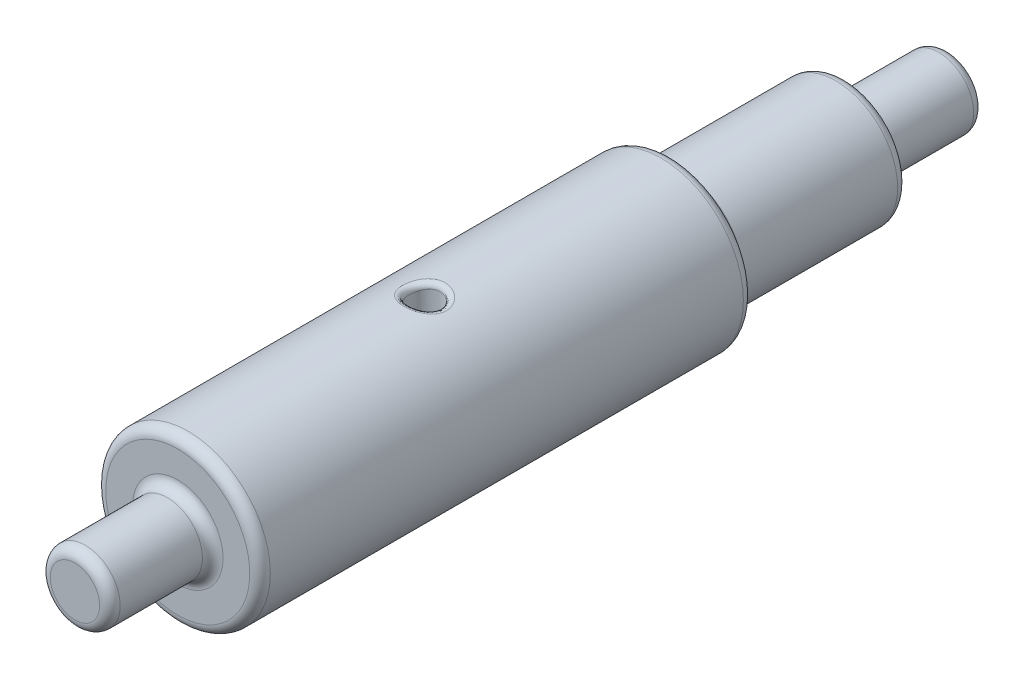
ISO-10303-21;
HEADER;
FILE_DESCRIPTION(('STEP AP214'),'2;1');
FILE_NAME('part.step','',(''),(''),'','','');
FILE_SCHEMA(('AUTOMOTIVE_DESIGN { 1 0 10303 214 1 1 1 1 }'));
ENDSEC;
DATA;
#1=APPLICATION_CONTEXT('core data for automotive mechanical design processes');
#2=APPLICATION_PROTOCOL_DEFINITION('international standard','automotive_design',2000,#1);
#3=PRODUCT_CONTEXT('',#1,'mechanical');
#4=PRODUCT('Part','Part','',(#3));
#5=PRODUCT_RELATED_PRODUCT_CATEGORY('part','',(#4));
#6=PRODUCT_DEFINITION_FORMATION('','',#4);
#7=PRODUCT_DEFINITION_CONTEXT('part definition',#1,'design');
#8=PRODUCT_DEFINITION('design','',#6,#7);
#9=PRODUCT_DEFINITION_SHAPE('','',#8);
#10=(LENGTH_UNIT() NAMED_UNIT(*) SI_UNIT(.MILLI.,.METRE.));
#11=(NAMED_UNIT(*) PLANE_ANGLE_UNIT() SI_UNIT($,.RADIAN.));
#12=(NAMED_UNIT(*) SI_UNIT($,.STERADIAN.) SOLID_ANGLE_UNIT());
#13=UNCERTAINTY_MEASURE_WITH_UNIT(LENGTH_MEASURE(1.E-05),#10,'distance_accuracy_value','');
#14=(GEOMETRIC_REPRESENTATION_CONTEXT(3) GLOBAL_UNCERTAINTY_ASSIGNED_CONTEXT((#13)) GLOBAL_UNIT_ASSIGNED_CONTEXT((#10,
#11,#12)) REPRESENTATION_CONTEXT('',''));
#15=CARTESIAN_POINT('',(0.,0.,0.));
#16=DIRECTION('',(0.,0.,1.));
#17=DIRECTION('',(1.,0.,0.));
#18=AXIS2_PLACEMENT_3D('',#15,#16,#17);
#19=CARTESIAN_POINT('',(0.,1.7,21.25));
#20=DIRECTION('',(0.,0.,-1.));
#21=DIRECTION('',(-1.,0.,0.));
#22=AXIS2_PLACEMENT_3D('',#19,#20,#21);
#23=PLANE('',#22);
#24=CARTESIAN_POINT('',(0.,0.,21.25));
#25=DIRECTION('',(0.,0.,-1.));
#26=DIRECTION('',(-1.,0.,0.));
#27=AXIS2_PLACEMENT_3D('',#24,#25,#26);
#28=CIRCLE('',#27,1.2);
#29=CARTESIAN_POINT('',(-1.2,0.,21.25));
#30=VERTEX_POINT('',#29);
#31=EDGE_CURVE('E117',#30,#30,#28,.F.);
#32=ORIENTED_EDGE('',*,*,#31,.T.);
#33=EDGE_LOOP('',(#32));
#34=FACE_BOUND('',#33,.T.);
#35=ADVANCED_FACE('F29',(#34),#23,.F.);
#36=CARTESIAN_POINT('',(0.,0.,-21.25));
#37=DIRECTION('',(0.,0.,1.));
#38=DIRECTION('',(1.,0.,0.));
#39=AXIS2_PLACEMENT_3D('',#36,#37,#38);
#40=PLANE('',#39);
#41=CARTESIAN_POINT('',(0.,0.,-21.25));
#42=DIRECTION('',(0.,0.,1.));
#43=DIRECTION('',(1.,0.,0.));
#44=AXIS2_PLACEMENT_3D('',#41,#42,#43);
#45=CIRCLE('',#44,1.2);
#46=CARTESIAN_POINT('',(1.2,0.,-21.25));
#47=VERTEX_POINT('',#46);
#48=EDGE_CURVE('E144',#47,#47,#45,.F.);
#49=ORIENTED_EDGE('',*,*,#48,.T.);
#50=EDGE_LOOP('',(#49));
#51=FACE_BOUND('',#50,.T.);
#52=ADVANCED_FACE('F193',(#51),#40,.F.);
#53=CARTESIAN_POINT('',(0.,0.,21.25));
#54=DIRECTION('',(0.,0.,1.));
#55=DIRECTION('',(1.,0.,0.));
#56=AXIS2_PLACEMENT_3D('',#53,#54,#55);
#57=CYLINDRICAL_SURFACE('',#56,1.7);
#58=CARTESIAN_POINT('',(0.,0.,-20.75));
#59=DIRECTION('',(0.,0.,1.));
#60=DIRECTION('',(1.,0.,0.));
#61=AXIS2_PLACEMENT_3D('',#58,#59,#60);
#62=CIRCLE('',#61,1.7);
#63=CARTESIAN_POINT('',(1.7,0.,-20.75));
#64=VERTEX_POINT('',#63);
#65=EDGE_CURVE('E147',#64,#64,#62,.T.);
#66=ORIENTED_EDGE('',*,*,#65,.T.);
#67=EDGE_LOOP('',(#66));
#68=FACE_BOUND('',#67,.T.);
#69=CARTESIAN_POINT('',(0.,0.,-16.75));
#70=DIRECTION('',(0.,0.,1.));
#71=DIRECTION('',(1.,0.,0.));
#72=AXIS2_PLACEMENT_3D('',#69,#70,#71);
#73=CIRCLE('',#72,1.7);
#74=CARTESIAN_POINT('',(1.7,0.,-16.75));
#75=VERTEX_POINT('',#74);
#76=EDGE_CURVE('E111',#75,#75,#73,.F.);
#77=ORIENTED_EDGE('',*,*,#76,.T.);
#78=EDGE_LOOP('',(#77));
#79=FACE_BOUND('',#78,.T.);
#80=ADVANCED_FACE('F153',(#68,#79),#57,.T.);
#81=CARTESIAN_POINT('',(0.,1.7,-16.25));
#82=DIRECTION('',(0.,0.,1.));
#83=DIRECTION('',(1.,0.,0.));
#84=AXIS2_PLACEMENT_3D('',#81,#82,#83);
#85=PLANE('',#84);
#86=CARTESIAN_POINT('',(0.,0.,-16.25));
#87=DIRECTION('',(0.,0.,1.));
#88=DIRECTION('',(1.,0.,0.));
#89=AXIS2_PLACEMENT_3D('',#86,#87,#88);
#90=CIRCLE('',#89,2.2);
#91=CARTESIAN_POINT('',(2.2,0.,-16.25));
#92=VERTEX_POINT('',#91);
#93=EDGE_CURVE('E138',#92,#92,#90,.T.);
#94=ORIENTED_EDGE('',*,*,#93,.T.);
#95=EDGE_LOOP('',(#94));
#96=FACE_BOUND('',#95,.T.);
#97=CARTESIAN_POINT('',(0.,0.,-16.25));
#98=DIRECTION('',(0.,0.,1.));
#99=DIRECTION('',(1.,0.,0.));
#100=AXIS2_PLACEMENT_3D('',#97,#98,#99);
#101=CIRCLE('',#100,2.5);
#102=CARTESIAN_POINT('',(2.5,0.,-16.25));
#103=VERTEX_POINT('',#102);
#104=EDGE_CURVE('E141',#103,#103,#101,.F.);
#105=ORIENTED_EDGE('',*,*,#104,.T.);
#106=EDGE_LOOP('',(#105));
#107=FACE_BOUND('',#106,.T.);
#108=ADVANCED_FACE('F163',(#96,#107),#85,.F.);
#109=CARTESIAN_POINT('',(0.,0.,21.25));
#110=DIRECTION('',(0.,0.,1.));
#111=DIRECTION('',(1.,0.,0.));
#112=AXIS2_PLACEMENT_3D('',#109,#110,#111);
#113=CYLINDRICAL_SURFACE('',#112,3.);
#114=CARTESIAN_POINT('',(0.,0.,-15.75));
#115=DIRECTION('',(0.,0.,1.));
#116=DIRECTION('',(1.,0.,0.));
#117=AXIS2_PLACEMENT_3D('',#114,#115,#116);
#118=CIRCLE('',#117,3.);
#119=CARTESIAN_POINT('',(3.,0.,-15.75));
#120=VERTEX_POINT('',#119);
#121=EDGE_CURVE('E132',#120,#120,#118,.T.);
#122=ORIENTED_EDGE('',*,*,#121,.T.);
#123=EDGE_LOOP('',(#122));
#124=FACE_BOUND('',#123,.T.);
#125=CARTESIAN_POINT('',(0.,0.,-8.25));
#126=DIRECTION('',(0.,0.,1.));
#127=DIRECTION('',(1.,0.,0.));
#128=AXIS2_PLACEMENT_3D('',#125,#126,#127);
#129=CIRCLE('',#128,3.);
#130=CARTESIAN_POINT('',(3.,0.,-8.25));
#131=VERTEX_POINT('',#130);
#132=EDGE_CURVE('E135',#131,#131,#129,.F.);
#133=ORIENTED_EDGE('',*,*,#132,.T.);
#134=EDGE_LOOP('',(#133));
#135=FACE_BOUND('',#134,.T.);
#136=ADVANCED_FACE('F82',(#124,#135),#113,.T.);
#137=CARTESIAN_POINT('',(0.,0.,21.25));
#138=DIRECTION('',(0.,0.,1.));
#139=DIRECTION('',(1.,0.,0.));
#140=AXIS2_PLACEMENT_3D('',#137,#138,#139);
#141=CYLINDRICAL_SURFACE('',#140,4.);
#142=CARTESIAN_POINT('',(-0.195879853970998,-3.74089408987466,4.97396897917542));
#143=CARTESIAN_POINT('',(-0.212404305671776,-3.99490745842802,4.96949805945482));
#144=CARTESIAN_POINT('',(-0.278584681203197,-3.99028702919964,5.21529197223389));
#145=CARTESIAN_POINT('',(-0.15539995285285,-3.74466208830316,4.98492130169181));
#146=CARTESIAN_POINT('',(-0.16905078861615,-3.99697783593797,4.98221507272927));
#147=CARTESIAN_POINT('',(-0.221013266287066,-3.99430622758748,5.22989506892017));
#148=CARTESIAN_POINT('',(-0.113944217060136,-3.7473366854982,4.99248412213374));
#149=CARTESIAN_POINT('',(-0.124016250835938,-3.99849396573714,4.991151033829));
#150=CARTESIAN_POINT('',(-0.162053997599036,-3.99715913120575,5.23997882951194));
#151=CARTESIAN_POINT('',(-0.0303069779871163,-3.75019672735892,5.00056363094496));
#152=CARTESIAN_POINT('',(-0.033100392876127,-4.00010842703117,5.00065269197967));
#153=CARTESIAN_POINT('',(-0.0431032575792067,-4.00020984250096,5.25075150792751));
#154=CARTESIAN_POINT('',(0.0118743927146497,-3.75038262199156,5.00108159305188));
#155=CARTESIAN_POINT('',(0.0130047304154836,-4.00021509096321,5.00126750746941));
#156=CARTESIAN_POINT('',(0.016888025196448,-4.00040813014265,5.25144212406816));
#157=CARTESIAN_POINT('',(0.0945300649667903,-3.74827555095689,4.99514011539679));
#158=CARTESIAN_POINT('',(0.102917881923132,-3.99902399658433,4.99427674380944));
#159=CARTESIAN_POINT('',(0.134442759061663,-3.99816058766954,5.24352015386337));
#160=CARTESIAN_POINT('',(0.135019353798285,-3.74605084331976,4.98887280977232));
#161=CARTESIAN_POINT('',(0.146968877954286,-3.99775924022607,4.98686429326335));
#162=CARTESIAN_POINT('',(0.192027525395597,-3.99578756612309,5.23516374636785));
#163=CARTESIAN_POINT('',(0.214398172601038,-3.73946493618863,4.96986205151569));
#164=CARTESIAN_POINT('',(0.232539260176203,-3.99410591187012,4.96465712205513));
#165=CARTESIAN_POINT('',(0.30492184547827,-3.98876259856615,5.20981606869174));
#166=CARTESIAN_POINT('',(0.253285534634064,-3.73510093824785,4.95711011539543));
#167=CARTESIAN_POINT('',(0.274226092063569,-3.99170026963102,4.94975420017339));
#168=CARTESIAN_POINT('',(0.360228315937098,-3.98410766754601,5.1928134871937));
#169=CARTESIAN_POINT('',(0.328596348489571,-3.72466236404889,4.92542868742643));
#170=CARTESIAN_POINT('',(0.353862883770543,-3.98614158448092,4.91332123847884));
#171=CARTESIAN_POINT('',(0.467337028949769,-3.97297318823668,5.15057158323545));
#172=CARTESIAN_POINT('',(0.365003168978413,-3.71857742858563,4.90646167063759));
#173=CARTESIAN_POINT('',(0.391888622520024,-3.98296585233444,4.89161265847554));
#174=CARTESIAN_POINT('',(0.519115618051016,-3.96648259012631,5.12528222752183));
#175=CARTESIAN_POINT('',(0.434171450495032,-3.70534126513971,4.8629161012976));
#176=CARTESIAN_POINT('',(0.462828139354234,-3.97636582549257,4.84276725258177));
#177=CARTESIAN_POINT('',(0.617488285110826,-3.95236401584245,5.06722146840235));
#178=CARTESIAN_POINT('',(0.466932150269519,-3.69818981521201,4.83833638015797));
#179=CARTESIAN_POINT('',(0.495757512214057,-3.97292950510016,4.81548902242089));
#180=CARTESIAN_POINT('',(0.664081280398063,-3.94473580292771,5.03444850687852));
#181=CARTESIAN_POINT('',(0.528965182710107,-3.68332638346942,4.78335436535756));
#182=CARTESIAN_POINT('',(0.556741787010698,-3.9661826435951,4.75590245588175));
#183=CARTESIAN_POINT('',(0.752306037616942,-3.92888147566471,4.96113915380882));
#184=CARTESIAN_POINT('',(0.558095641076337,-3.67560385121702,4.75279344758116));
#185=CARTESIAN_POINT('',(0.584524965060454,-3.96288155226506,4.72337146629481));
#186=CARTESIAN_POINT('',(0.79373602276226,-3.92064410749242,4.92039126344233));
#187=CARTESIAN_POINT('',(0.61081815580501,-3.66067016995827,4.68722811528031));
#188=CARTESIAN_POINT('',(0.633506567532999,-3.95693163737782,4.65551176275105));
#189=CARTESIAN_POINT('',(0.868719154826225,-3.90471484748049,4.83297082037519));
#190=CARTESIAN_POINT('',(0.634417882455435,-3.65345832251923,4.65222995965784));
#191=CARTESIAN_POINT('',(0.654578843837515,-3.95429573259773,4.62016360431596));
#192=CARTESIAN_POINT('',(0.902283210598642,-3.89702221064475,4.78630661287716));
#193=CARTESIAN_POINT('',(0.67567882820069,-3.64028593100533,4.57828135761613));
#194=CARTESIAN_POINT('',(0.690479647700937,-3.94983394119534,4.54758150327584));
#195=CARTESIAN_POINT('',(0.960965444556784,-3.88297165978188,4.68770847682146));
#196=CARTESIAN_POINT('',(0.693276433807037,-3.63433902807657,4.53929394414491));
#197=CARTESIAN_POINT('',(0.705077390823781,-3.94803765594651,4.51042231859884));
#198=CARTESIAN_POINT('',(0.985993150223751,-3.8766282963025,4.63572525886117));
#199=CARTESIAN_POINT('',(0.721621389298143,-3.62451783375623,4.45876644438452));
#200=CARTESIAN_POINT('',(0.728143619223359,-3.94526174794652,4.43552689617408));
#201=CARTESIAN_POINT('',(1.02630597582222,-3.8661523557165,4.5283552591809));
#202=CARTESIAN_POINT('',(0.732370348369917,-3.62064305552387,4.41722696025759));
#203=CARTESIAN_POINT('',(0.736477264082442,-3.94429932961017,4.39797532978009));
#204=CARTESIAN_POINT('',(1.04159338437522,-3.86201925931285,4.47296928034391));
#205=CARTESIAN_POINT('',(0.746437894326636,-3.61553164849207,4.33402515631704));
#206=CARTESIAN_POINT('',(0.747345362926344,-3.94306175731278,4.32372827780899));
#207=CARTESIAN_POINT('',(1.06160056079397,-3.85656709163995,4.36203354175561));
#208=CARTESIAN_POINT('',(0.749957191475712,-3.61422380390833,4.29239923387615));
#209=CARTESIAN_POINT('',(0.749967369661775,-3.94277605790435,4.28726417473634));
#210=CARTESIAN_POINT('',(1.0666057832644,-3.85517205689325,4.30653231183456));
#211=CARTESIAN_POINT('',(0.750042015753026,-3.61419263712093,4.20914298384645));
#212=CARTESIAN_POINT('',(0.75003203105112,-3.94276889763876,4.21408961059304));
#213=CARTESIAN_POINT('',(1.06672642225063,-3.85513881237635,4.19552397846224));
#214=CARTESIAN_POINT('',(0.746608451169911,-3.61546897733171,4.16751265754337));
#215=CARTESIAN_POINT('',(0.747474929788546,-3.94304741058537,4.17762774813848));
#216=CARTESIAN_POINT('',(1.0618431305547,-3.85650024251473,4.14001687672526));
#217=CARTESIAN_POINT('',(0.733071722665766,-3.62038885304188,4.08642341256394));
#218=CARTESIAN_POINT('',(0.737018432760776,-3.94423737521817,4.10528236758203));
#219=CARTESIAN_POINT('',(1.04259089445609,-3.86174810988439,4.03189788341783));
#220=CARTESIAN_POINT('',(0.723123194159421,-3.62397747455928,4.04693659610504));
#221=CARTESIAN_POINT('',(0.729307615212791,-3.9451266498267,4.06962655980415));
#222=CARTESIAN_POINT('',(1.02844187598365,-3.86557597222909,3.97924879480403));
#223=CARTESIAN_POINT('',(0.697010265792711,-3.63306152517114,3.97013384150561));
#224=CARTESIAN_POINT('',(0.708142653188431,-3.94766499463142,3.99841859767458));
#225=CARTESIAN_POINT('',(0.991303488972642,-3.87526562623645,3.87684512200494));
#226=CARTESIAN_POINT('',(0.680834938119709,-3.63856030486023,3.93282185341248));
#227=CARTESIAN_POINT('',(0.694792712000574,-3.94930088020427,3.96302892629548));
#228=CARTESIAN_POINT('',(0.968298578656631,-3.88113099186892,3.82709580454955));
#229=CARTESIAN_POINT('',(0.64239529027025,-3.65096787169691,3.86073471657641));
#230=CARTESIAN_POINT('',(0.661610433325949,-3.95341987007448,3.89272556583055));
#231=CARTESIAN_POINT('',(0.913628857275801,-3.89436572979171,3.73097962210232));
#232=CARTESIAN_POINT('',(0.620024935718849,-3.65790062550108,3.82601850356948));
#233=CARTESIAN_POINT('',(0.64180466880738,-3.95589980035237,3.8579097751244));
#234=CARTESIAN_POINT('',(0.881813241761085,-3.90176066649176,3.68469133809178));
#235=CARTESIAN_POINT('',(0.569941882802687,-3.67235375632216,3.76075700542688));
#236=CARTESIAN_POINT('',(0.595666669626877,-3.96154309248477,3.79082507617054));
#237=CARTESIAN_POINT('',(0.810584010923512,-3.91717733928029,3.59767600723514));
#238=CARTESIAN_POINT('',(0.542228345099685,-3.67987422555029,3.73021237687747));
#239=CARTESIAN_POINT('',(0.569465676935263,-3.96469230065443,3.75854796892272));
#240=CARTESIAN_POINT('',(0.771169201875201,-3.92519917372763,3.55694983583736));
#241=CARTESIAN_POINT('',(0.48123519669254,-3.69493553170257,3.67319108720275));
#242=CARTESIAN_POINT('',(0.510014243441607,-3.97140268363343,3.6971858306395));
#243=CARTESIAN_POINT('',(0.684423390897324,-3.94126456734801,3.48092144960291));
#244=CARTESIAN_POINT('',(0.447810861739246,-3.702469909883,3.64686804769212));
#245=CARTESIAN_POINT('',(0.476640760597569,-3.9749725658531,3.66811513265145));
#246=CARTESIAN_POINT('',(0.636886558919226,-3.94930123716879,3.44582406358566));
#247=CARTESIAN_POINT('',(0.376917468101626,-3.71647858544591,3.60020610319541));
#248=CARTESIAN_POINT('',(0.404265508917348,-3.98188754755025,3.61597162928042));
#249=CARTESIAN_POINT('',(0.536060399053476,-3.96424382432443,3.38360813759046));
#250=CARTESIAN_POINT('',(0.339450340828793,-3.72295338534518,3.57986435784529));
#251=CARTESIAN_POINT('',(0.36526009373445,-3.9852446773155,3.59274218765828));
#252=CARTESIAN_POINT('',(0.482773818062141,-3.97115027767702,3.35648581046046));
#253=CARTESIAN_POINT('',(0.266666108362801,-3.73338166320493,3.54803713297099));
#254=CARTESIAN_POINT('',(0.288408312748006,-3.99077642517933,3.55617777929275));
#255=CARTESIAN_POINT('',(0.379258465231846,-3.98227377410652,3.31404951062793));
#256=CARTESIAN_POINT('',(0.231721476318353,-3.73755549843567,3.5357355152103));
#257=CARTESIAN_POINT('',(0.251068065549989,-3.99305951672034,3.54185182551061));
#258=CARTESIAN_POINT('',(0.32955943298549,-3.98672586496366,3.29764735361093));
#259=CARTESIAN_POINT('',(0.160318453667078,-3.7442065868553,3.51640237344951));
#260=CARTESIAN_POINT('',(0.174301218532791,-3.99672860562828,3.51931661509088));
#261=CARTESIAN_POINT('',(0.228008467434,-3.99382035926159,3.27186983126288));
#262=CARTESIAN_POINT('',(0.12386034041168,-3.74668414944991,3.50936988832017));
#263=CARTESIAN_POINT('',(0.134755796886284,-3.99812715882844,3.51102605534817));
#264=CARTESIAN_POINT('',(0.176156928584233,-3.99646309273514,3.26249318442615));
#265=CARTESIAN_POINT('',(0.0462959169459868,-3.74988536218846,3.50030718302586));
#266=CARTESIAN_POINT('',(0.0505181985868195,-3.99993065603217,3.50037794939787));
#267=CARTESIAN_POINT('',(0.0658430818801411,-3.99987771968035,3.25040957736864));
#268=CARTESIAN_POINT('',(0.00511071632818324,-3.75039221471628,3.49889489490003));
#269=CARTESIAN_POINT('',(0.00551871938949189,-4.0002215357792,3.49870113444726));
#270=CARTESIAN_POINT('',(0.00726857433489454,-4.00041836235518,3.24852652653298));
#271=CARTESIAN_POINT('',(-0.0769211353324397,-3.7489965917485,3.50282500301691));
#272=CARTESIAN_POINT('',(-0.0837638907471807,-3.99943171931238,3.50332741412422));
#273=CARTESIAN_POINT('',(-0.109398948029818,-3.998929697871,3.25376667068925));
#274=CARTESIAN_POINT('',(-0.117767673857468,-3.74709334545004,3.50816956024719));
#275=CARTESIAN_POINT('',(-0.128261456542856,-3.99834675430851,3.50965541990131));
#276=CARTESIAN_POINT('',(-0.167491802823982,-3.99689956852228,3.26089274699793));
#277=CARTESIAN_POINT('',(-0.19788605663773,-3.74108848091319,3.52541892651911));
#278=CARTESIAN_POINT('',(-0.214790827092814,-3.99500262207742,3.52983548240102));
#279=CARTESIAN_POINT('',(-0.281437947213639,-3.99049437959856,3.28389190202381));
#280=CARTESIAN_POINT('',(-0.237160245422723,-3.73699027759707,3.53731354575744));
#281=CARTESIAN_POINT('',(-0.257007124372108,-3.99273056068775,3.54376733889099));
#282=CARTESIAN_POINT('',(-0.337294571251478,-3.98612296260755,3.29975139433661));
#283=CARTESIAN_POINT('',(-0.313191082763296,-3.72702573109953,3.56729639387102));
#284=CARTESIAN_POINT('',(-0.337670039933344,-3.98738685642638,3.5783391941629));
#285=CARTESIAN_POINT('',(-0.445427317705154,-3.97549411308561,3.33972852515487));
#286=CARTESIAN_POINT('',(-0.349944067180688,-3.72115687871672,3.58539341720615));
#287=CARTESIAN_POINT('',(-0.37622417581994,-3.98429564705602,3.59912398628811));
#288=CARTESIAN_POINT('',(-0.497698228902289,-3.96923400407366,3.36385788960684));
#289=CARTESIAN_POINT('',(-0.420469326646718,-3.70816503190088,3.62756983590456));
#290=CARTESIAN_POINT('',(-0.448923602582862,-3.97774649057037,3.64663055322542));
#291=CARTESIAN_POINT('',(-0.598000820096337,-3.95537603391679,3.42009311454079));
#292=CARTESIAN_POINT('',(-0.454187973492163,-3.70102437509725,3.65173575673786));
#293=CARTESIAN_POINT('',(-0.48301550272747,-3.97427061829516,3.67357987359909));
#294=CARTESIAN_POINT('',(-0.645956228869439,-3.94775933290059,3.45231434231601));
#295=CARTESIAN_POINT('',(-0.517163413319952,-3.68630429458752,3.70525222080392));
#296=CARTESIAN_POINT('',(-0.545291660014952,-3.96749775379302,3.73185378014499));
#297=CARTESIAN_POINT('',(-0.735521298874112,-3.9320579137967,3.52366962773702));
#298=CARTESIAN_POINT('',(-0.546419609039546,-3.67872481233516,3.73460345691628));
#299=CARTESIAN_POINT('',(-0.573417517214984,-3.96419935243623,3.76328949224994));
#300=CARTESIAN_POINT('',(-0.77713011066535,-3.92397313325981,3.56280460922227));
#301=CARTESIAN_POINT('',(-0.60047668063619,-3.66372462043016,3.79863379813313));
#302=CARTESIAN_POINT('',(-0.624088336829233,-3.95809766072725,3.8300449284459));
#303=CARTESIAN_POINT('',(-0.854011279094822,-3.90797292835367,3.64817839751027));
#304=CARTESIAN_POINT('',(-0.625130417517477,-3.65631424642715,3.83343874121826));
#305=CARTESIAN_POINT('',(-0.646311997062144,-3.95532474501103,3.86546948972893));
#306=CARTESIAN_POINT('',(-0.889074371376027,-3.90006852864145,3.69458498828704));
#307=CARTESIAN_POINT('',(-0.668205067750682,-3.6427460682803,3.90676962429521));
#308=CARTESIAN_POINT('',(-0.684124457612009,-3.95062263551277,3.93795995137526));
#309=CARTESIAN_POINT('',(-0.950336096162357,-3.88559580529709,3.79235949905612));
#310=CARTESIAN_POINT('',(-0.686635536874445,-3.63658634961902,3.94528974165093));
#311=CARTESIAN_POINT('',(-0.699562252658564,-3.94871250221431,3.97495381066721));
#312=CARTESIAN_POINT('',(-0.976548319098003,-3.87902543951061,3.8437196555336));
#313=CARTESIAN_POINT('',(-0.716613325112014,-3.626289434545,4.02471709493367));
#314=CARTESIAN_POINT('',(-0.724158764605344,-3.94573322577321,4.04931677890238));
#315=CARTESIAN_POINT('',(-1.01918339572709,-3.86804206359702,3.94962279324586));
#316=CARTESIAN_POINT('',(-0.728214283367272,-3.62213652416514,4.06560288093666));
#317=CARTESIAN_POINT('',(-0.733228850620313,-3.9446752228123,4.08651533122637));
#318=CARTESIAN_POINT('',(-1.03568253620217,-3.86361229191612,4.00413717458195));
#319=CARTESIAN_POINT('',(-0.744353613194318,-3.61630023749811,4.14883838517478));
#320=CARTESIAN_POINT('',(-0.745771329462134,-3.94323642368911,4.1611335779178));
#321=CARTESIAN_POINT('',(-1.05863624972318,-3.85738691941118,4.11511784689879));
#322=CARTESIAN_POINT('',(-0.748893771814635,-3.61461623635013,4.19118773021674));
#323=CARTESIAN_POINT('',(-0.749162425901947,-3.94286521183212,4.19831666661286));
#324=CARTESIAN_POINT('',(-1.06509336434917,-3.85559065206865,4.17158364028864));
#325=CARTESIAN_POINT('',(-0.75071802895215,-3.61394310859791,4.27466045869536));
#326=CARTESIAN_POINT('',(-0.75054405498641,-3.94271217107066,4.27170051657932));
#327=CARTESIAN_POINT('',(-1.06768786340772,-3.85487264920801,4.28288061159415));
#328=CARTESIAN_POINT('',(-0.74823504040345,-3.61486747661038,4.31577853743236));
#329=CARTESIAN_POINT('',(-0.748698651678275,-3.94291244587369,4.30765242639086));
#330=CARTESIAN_POINT('',(-1.06415650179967,-3.85585864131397,4.33770471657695));
#331=CARTESIAN_POINT('',(-0.736598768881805,-3.61911327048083,4.39698555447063));
#332=CARTESIAN_POINT('',(-0.739754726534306,-3.94392371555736,4.37982445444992));
#333=CARTESIAN_POINT('',(-1.04760713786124,-3.86038748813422,4.44598073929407));
#334=CARTESIAN_POINT('',(-0.72744553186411,-3.62243467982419,4.43707449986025));
#335=CARTESIAN_POINT('',(-0.732712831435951,-3.94472821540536,4.41581975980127));
#336=CARTESIAN_POINT('',(-1.03458920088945,-3.86393032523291,4.4994326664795));
#337=CARTESIAN_POINT('',(-0.702842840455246,-3.63105798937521,4.51489365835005));
#338=CARTESIAN_POINT('',(-0.712921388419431,-3.94708581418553,4.48753530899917));
#339=CARTESIAN_POINT('',(-0.999598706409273,-3.87312852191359,4.60319154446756));
#340=CARTESIAN_POINT('',(-0.687428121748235,-3.63634895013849,4.55263558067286));
#341=CARTESIAN_POINT('',(-0.700313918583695,-3.94862087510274,4.52308040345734));
#342=CARTESIAN_POINT('',(-0.977675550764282,-3.87877221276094,4.65351410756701));
#343=CARTESIAN_POINT('',(-0.650740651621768,-3.64832956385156,4.62508437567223));
#344=CARTESIAN_POINT('',(-0.668909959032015,-3.9525103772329,4.59326039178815));
#345=CARTESIAN_POINT('',(-0.925497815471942,-3.89155153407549,4.7501125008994));
#346=CARTESIAN_POINT('',(-0.629459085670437,-3.65502131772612,4.65978657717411));
#347=CARTESIAN_POINT('',(-0.650242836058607,-3.95484810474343,4.62779896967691));
#348=CARTESIAN_POINT('',(-0.895230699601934,-3.89868940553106,4.79638210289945));
#349=CARTESIAN_POINT('',(-0.580899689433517,-3.66929520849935,4.72623436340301));
#350=CARTESIAN_POINT('',(-0.605914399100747,-3.96030214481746,4.69559722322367));
#351=CARTESIAN_POINT('',(-0.826168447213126,-3.91391488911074,4.88497915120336));
#352=CARTESIAN_POINT('',(-0.553461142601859,-3.6768980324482,4.7578600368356));
#353=CARTESIAN_POINT('',(-0.580189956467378,-3.96342517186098,4.72879962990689));
#354=CARTESIAN_POINT('',(-0.787144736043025,-3.92202456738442,4.92714671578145));
#355=CARTESIAN_POINT('',(-0.493705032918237,-3.69199369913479,4.81612460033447));
#356=CARTESIAN_POINT('',(-0.522314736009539,-3.97005164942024,4.7911776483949));
#357=CARTESIAN_POINT('',(-0.70215826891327,-3.93812661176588,5.00483280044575));
#358=CARTESIAN_POINT('',(-0.461387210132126,-3.69948653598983,4.84276322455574));
#359=CARTESIAN_POINT('',(-0.49025445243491,-3.97355067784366,4.82043878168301));
#360=CARTESIAN_POINT('',(-0.656195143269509,-3.94611897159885,5.04035096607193));
#361=CARTESIAN_POINT('',(-0.392014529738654,-3.71369462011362,4.89081130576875));
#362=CARTESIAN_POINT('',(-0.419839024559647,-3.98047785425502,4.87387937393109));
#363=CARTESIAN_POINT('',(-0.557531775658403,-3.9612742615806,5.10441507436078));
#364=CARTESIAN_POINT('',(-0.354879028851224,-3.72039168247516,4.91210765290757));
#365=CARTESIAN_POINT('',(-0.381369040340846,-3.98391445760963,4.89810538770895));
#366=CARTESIAN_POINT('',(-0.504716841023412,-3.96841779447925,5.13281020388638));
#367=CARTESIAN_POINT('',(-0.277457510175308,-3.73206807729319,4.94809472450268));
#368=CARTESIAN_POINT('',(-0.299981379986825,-3.99005442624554,4.93929081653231));
#369=CARTESIAN_POINT('',(-0.394606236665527,-3.98087261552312,5.18079296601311));
#370=CARTESIAN_POINT('',(-0.237176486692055,-3.73705006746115,4.96279568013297));
#371=CARTESIAN_POINT('',(-0.25697595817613,-3.99277890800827,4.95642372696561));
#372=CARTESIAN_POINT('',(-0.337317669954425,-3.98618673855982,5.20039424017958));
#373=CARTESIAN_POINT('',(-0.195879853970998,-3.74089408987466,4.97396897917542));
#374=CARTESIAN_POINT('',(-0.212404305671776,-3.99490745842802,4.96949805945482));
#375=CARTESIAN_POINT('',(-0.278584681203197,-3.99028702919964,5.21529197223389));
#376=(BOUNDED_SURFACE() B_SPLINE_SURFACE(3,2,((#142,#143,#144),(#145,#146,#147),(#148,#149,
#150),(#151,#152,#153),(#154,#155,#156),(#157,#158,#159),(#160,#161,#162),(#163,#164,#165),
(#166,#167,#168),(#169,#170,#171),(#172,#173,#174),(#175,#176,#177),(#178,#179,#180),(#181,#182,
#183),(#184,#185,#186),(#187,#188,#189),(#190,#191,#192),(#193,#194,#195),(#196,#197,#198),
(#199,#200,#201),(#202,#203,#204),(#205,#206,#207),(#208,#209,#210),(#211,#212,#213),(#214,#215,
#216),(#217,#218,#219),(#220,#221,#222),(#223,#224,#225),(#226,#227,#228),(#229,#230,#231),
(#232,#233,#234),(#235,#236,#237),(#238,#239,#240),(#241,#242,#243),(#244,#245,#246),(#247,#248,
#249),(#250,#251,#252),(#253,#254,#255),(#256,#257,#258),(#259,#260,#261),(#262,#263,#264),
(#265,#266,#267),(#268,#269,#270),(#271,#272,#273),(#274,#275,#276),(#277,#278,#279),(#280,#281,
#282),(#283,#284,#285),(#286,#287,#288),(#289,#290,#291),(#292,#293,#294),(#295,#296,#297),
(#298,#299,#300),(#301,#302,#303),(#304,#305,#306),(#307,#308,#309),(#310,#311,#312),(#313,#314,
#315),(#316,#317,#318),(#319,#320,#321),(#322,#323,#324),(#325,#326,#327),(#328,#329,#330),
(#331,#332,#333),(#334,#335,#336),(#337,#338,#339),(#340,#341,#342),(#343,#344,#345),(#346,#347,
#348),(#349,#350,#351),(#352,#353,#354),(#355,#356,#357),(#358,#359,#360),(#361,#362,#363),
(#364,#365,#366),(#367,#368,#369),(#370,#371,#372),(#373,#374,#375)),.UNSPECIFIED.,.T.,.F.,
.F.) B_SPLINE_SURFACE_WITH_KNOTS((4,2,2,2,2,2,2,2,2,2,2,2,2,2,2,2,2,2,2,2,2,2,2,2,2,2,2,2,2,2,2,
2,2,2,2,2,2,2,4),(3,3),(0.,0.167913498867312,0.335796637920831,0.499047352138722,
0.662512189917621,0.826982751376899,0.991487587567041,1.16115902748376,1.33059374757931,
1.50177214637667,1.67291030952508,1.83922935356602,2.00552667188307,2.1680133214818,
2.33078643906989,2.49653897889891,2.662317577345,2.83318410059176,3.00396935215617,
3.15213502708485,3.30027366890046,3.46431263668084,3.62840408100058,3.79224096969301,
3.95631113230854,4.12286835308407,4.28944784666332,4.46067661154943,4.63164124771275,
4.80124456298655,4.97080494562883,5.1348086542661,5.29881123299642,5.46191616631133,
5.6252675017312,5.79351875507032,5.96177897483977,6.13334740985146,6.30464876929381),(0.,1.),
.UNSPECIFIED.) GEOMETRIC_REPRESENTATION_ITEM() RATIONAL_B_SPLINE_SURFACE(((1.,0.700646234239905,
1.),(1.,0.703328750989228,1.),(1.,0.705222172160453,1.),(1.,0.707246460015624,1.),(1.,
0.707377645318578,1.),(1.,0.705886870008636,1.),(1.,0.7043131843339,1.),(1.,0.699631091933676,
1.),(1.,0.696520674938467,1.),(1.,0.689027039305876,1.),(1.,0.68463610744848,1.),(1.,
0.674999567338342,1.),(1.,0.669753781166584,1.),(1.,0.658743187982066,1.),(1.,0.652967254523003,
1.),(1.,0.641684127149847,1.),(1.,0.636176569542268,1.),(1.,0.626028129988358,1.),(1.,
0.62139675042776,1.),(1.,0.613701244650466,1.),(1.,0.610636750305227,1.),(1.,0.606585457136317,
1.),(1.,0.605542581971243,1.),(1.,0.605517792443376,1.),(1.,0.606535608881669,1.),(1.,
0.610435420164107,1.),(1.,0.613274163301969,1.),(1.,0.620398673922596,1.),(1.,0.624686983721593,
1.),(1.,0.634266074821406,1.),(1.,0.639573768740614,1.),(1.,0.65052334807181,1.),(1.,
0.656165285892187,1.),(1.,0.667356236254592,1.),(1.,0.672897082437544,1.),(1.,0.683116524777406,
1.),(1.,0.687795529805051,1.),(1.,0.695289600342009,1.),(1.,0.698269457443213,1.),(1.,
0.703004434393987,1.),(1.,0.704759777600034,1.),(1.,0.707026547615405,1.),(1.,0.707384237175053,
1.),(1.,0.706397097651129,1.),(1.,0.705051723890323,1.),(1.,0.700786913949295,1.),(1.,
0.697869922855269,1.),(1.,0.690728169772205,1.),(1.,0.686501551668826,1.),(1.,0.677063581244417,
1.),(1.,0.671838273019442,1.),(1.,0.660959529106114,1.),(1.,0.655306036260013,1.),(1.,
0.644004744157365,1.),(1.,0.63836150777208,1.),(1.,0.627933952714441,1.),(1.,0.623148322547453,
1.),(1.,0.615095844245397,1.),(1.,0.611817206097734,1.),(1.,0.607196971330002,1.),(1.,
0.605854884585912,1.),(1.,0.605319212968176,1.),(1.,0.606056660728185,1.),(1.,0.609425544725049,
1.),(1.,0.612056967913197,1.),(1.,0.618831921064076,1.),(1.,0.622967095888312,1.),(1.,
0.632237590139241,1.),(1.,0.637374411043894,1.),(1.,0.64821819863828,1.),(1.,0.653937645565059,
1.),(1.,0.665181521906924,1.),(1.,0.670705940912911,1.),(1.,0.681095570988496,1.),(1.,
0.685945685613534,1.),(1.,0.694351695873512,1.),(1.,0.697909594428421,1.),(1.,0.700646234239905,1.))) REPRESENTATION_ITEM('') SURFACE());
#377=CARTESIAN_POINT('',(-0.278584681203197,-3.99028702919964,5.21529197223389));
#378=CARTESIAN_POINT('',(-0.221013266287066,-3.99430622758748,5.22989506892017));
#379=CARTESIAN_POINT('',(-0.162053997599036,-3.99715913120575,5.23997882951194));
#380=CARTESIAN_POINT('',(-0.0431032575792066,-4.00020984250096,5.25075150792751));
#381=CARTESIAN_POINT('',(0.016888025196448,-4.00040813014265,5.25144212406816));
#382=CARTESIAN_POINT('',(0.134442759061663,-3.99816058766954,5.24352015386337));
#383=CARTESIAN_POINT('',(0.192027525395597,-3.99578756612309,5.23516374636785));
#384=CARTESIAN_POINT('',(0.30492184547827,-3.98876259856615,5.20981606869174));
#385=CARTESIAN_POINT('',(0.360228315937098,-3.984107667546,5.1928134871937));
#386=CARTESIAN_POINT('',(0.467337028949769,-3.97297318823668,5.15057158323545));
#387=CARTESIAN_POINT('',(0.519115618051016,-3.96648259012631,5.12528222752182));
#388=CARTESIAN_POINT('',(0.617488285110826,-3.95236401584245,5.06722146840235));
#389=CARTESIAN_POINT('',(0.664081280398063,-3.94473580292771,5.03444850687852));
#390=CARTESIAN_POINT('',(0.752306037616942,-3.92888147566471,4.96113915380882));
#391=CARTESIAN_POINT('',(0.79373602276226,-3.92064410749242,4.92039126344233));
#392=CARTESIAN_POINT('',(0.868719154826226,-3.90471484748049,4.83297082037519));
#393=CARTESIAN_POINT('',(0.902283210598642,-3.89702221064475,4.78630661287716));
#394=CARTESIAN_POINT('',(0.960965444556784,-3.88297165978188,4.68770847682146));
#395=CARTESIAN_POINT('',(0.98599315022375,-3.8766282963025,4.63572525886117));
#396=CARTESIAN_POINT('',(1.02630597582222,-3.8661523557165,4.5283552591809));
#397=CARTESIAN_POINT('',(1.04159338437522,-3.86201925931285,4.47296928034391));
#398=CARTESIAN_POINT('',(1.06160056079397,-3.85656709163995,4.36203354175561));
#399=CARTESIAN_POINT('',(1.0666057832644,-3.85517205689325,4.30653231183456));
#400=CARTESIAN_POINT('',(1.06672642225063,-3.85513881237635,4.19552397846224));
#401=CARTESIAN_POINT('',(1.0618431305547,-3.85650024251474,4.14001687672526));
#402=CARTESIAN_POINT('',(1.04259089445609,-3.86174810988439,4.03189788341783));
#403=CARTESIAN_POINT('',(1.02844187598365,-3.86557597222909,3.97924879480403));
#404=CARTESIAN_POINT('',(0.991303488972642,-3.87526562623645,3.87684512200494));
#405=CARTESIAN_POINT('',(0.968298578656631,-3.88113099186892,3.82709580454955));
#406=CARTESIAN_POINT('',(0.913628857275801,-3.89436572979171,3.73097962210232));
#407=CARTESIAN_POINT('',(0.881813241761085,-3.90176066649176,3.68469133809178));
#408=CARTESIAN_POINT('',(0.810584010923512,-3.91717733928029,3.59767600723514));
#409=CARTESIAN_POINT('',(0.771169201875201,-3.92519917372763,3.55694983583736));
#410=CARTESIAN_POINT('',(0.684423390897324,-3.94126456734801,3.48092144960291));
#411=CARTESIAN_POINT('',(0.636886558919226,-3.94930123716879,3.44582406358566));
#412=CARTESIAN_POINT('',(0.536060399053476,-3.96424382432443,3.38360813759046));
#413=CARTESIAN_POINT('',(0.482773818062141,-3.97115027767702,3.35648581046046));
#414=CARTESIAN_POINT('',(0.379258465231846,-3.98227377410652,3.31404951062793));
#415=CARTESIAN_POINT('',(0.32955943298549,-3.98672586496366,3.29764735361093));
#416=CARTESIAN_POINT('',(0.228008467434,-3.99382035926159,3.27186983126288));
#417=CARTESIAN_POINT('',(0.176156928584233,-3.99646309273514,3.26249318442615));
#418=CARTESIAN_POINT('',(0.0658430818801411,-3.99987771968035,3.25040957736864));
#419=CARTESIAN_POINT('',(0.00726857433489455,-4.00041836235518,3.24852652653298));
#420=CARTESIAN_POINT('',(-0.109398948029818,-3.998929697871,3.25376667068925));
#421=CARTESIAN_POINT('',(-0.167491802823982,-3.99689956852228,3.26089274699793));
#422=CARTESIAN_POINT('',(-0.281437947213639,-3.99049437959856,3.28389190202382));
#423=CARTESIAN_POINT('',(-0.337294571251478,-3.98612296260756,3.29975139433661));
#424=CARTESIAN_POINT('',(-0.445427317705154,-3.97549411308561,3.33972852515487));
#425=CARTESIAN_POINT('',(-0.497698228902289,-3.96923400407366,3.36385788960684));
#426=CARTESIAN_POINT('',(-0.598000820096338,-3.95537603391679,3.42009311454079));
#427=CARTESIAN_POINT('',(-0.64595622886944,-3.94775933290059,3.45231434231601));
#428=CARTESIAN_POINT('',(-0.735521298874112,-3.9320579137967,3.52366962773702));
#429=CARTESIAN_POINT('',(-0.77713011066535,-3.92397313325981,3.56280460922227));
#430=CARTESIAN_POINT('',(-0.854011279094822,-3.90797292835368,3.64817839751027));
#431=CARTESIAN_POINT('',(-0.889074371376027,-3.90006852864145,3.69458498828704));
#432=CARTESIAN_POINT('',(-0.950336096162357,-3.88559580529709,3.79235949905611));
#433=CARTESIAN_POINT('',(-0.976548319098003,-3.8790254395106,3.8437196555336));
#434=CARTESIAN_POINT('',(-1.01918339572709,-3.86804206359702,3.94962279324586));
#435=CARTESIAN_POINT('',(-1.03568253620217,-3.86361229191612,4.00413717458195));
#436=CARTESIAN_POINT('',(-1.05863624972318,-3.85738691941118,4.11511784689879));
#437=CARTESIAN_POINT('',(-1.06509336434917,-3.85559065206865,4.17158364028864));
#438=CARTESIAN_POINT('',(-1.06768786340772,-3.85487264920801,4.28288061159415));
#439=CARTESIAN_POINT('',(-1.06415650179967,-3.85585864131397,4.33770471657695));
#440=CARTESIAN_POINT('',(-1.04760713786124,-3.86038748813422,4.44598073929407));
#441=CARTESIAN_POINT('',(-1.03458920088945,-3.86393032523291,4.4994326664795));
#442=CARTESIAN_POINT('',(-0.999598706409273,-3.87312852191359,4.60319154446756));
#443=CARTESIAN_POINT('',(-0.977675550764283,-3.87877221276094,4.65351410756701));
#444=CARTESIAN_POINT('',(-0.925497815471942,-3.89155153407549,4.7501125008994));
#445=CARTESIAN_POINT('',(-0.895230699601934,-3.89868940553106,4.79638210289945));
#446=CARTESIAN_POINT('',(-0.826168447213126,-3.91391488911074,4.88497915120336));
#447=CARTESIAN_POINT('',(-0.787144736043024,-3.92202456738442,4.92714671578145));
#448=CARTESIAN_POINT('',(-0.70215826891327,-3.93812661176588,5.00483280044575));
#449=CARTESIAN_POINT('',(-0.656195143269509,-3.94611897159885,5.04035096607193));
#450=CARTESIAN_POINT('',(-0.557531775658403,-3.9612742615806,5.10441507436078));
#451=CARTESIAN_POINT('',(-0.504716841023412,-3.96841779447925,5.13281020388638));
#452=CARTESIAN_POINT('',(-0.394606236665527,-3.98087261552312,5.18079296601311));
#453=CARTESIAN_POINT('',(-0.337317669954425,-3.98618673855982,5.20039424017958));
#454=CARTESIAN_POINT('',(-0.278584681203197,-3.99028702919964,5.21529197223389));
#455=B_SPLINE_CURVE_WITH_KNOTS('',3,(#377,#378,#379,#380,#381,#382,#383,#384,#385,#386,#387,
#388,#389,#390,#391,#392,#393,#394,#395,#396,#397,#398,#399,#400,#401,#402,#403,#404,#405,#406,
#407,#408,#409,#410,#411,#412,#413,#414,#415,#416,#417,#418,#419,#420,#421,#422,#423,#424,#425,
#426,#427,#428,#429,#430,#431,#432,#433,#434,#435,#436,#437,#438,#439,#440,#441,#442,#443,#444,
#445,#446,#447,#448,#449,#450,#451,#452,#453,#454),.UNSPECIFIED.,.T.,.F.,(4,2,2,2,2,2,2,2,2,2,2,
2,2,2,2,2,2,2,2,2,2,2,2,2,2,2,2,2,2,2,2,2,2,2,2,2,2,2,4),(0.,0.167913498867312,
0.335796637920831,0.499047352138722,0.662512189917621,0.826982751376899,0.991487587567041,
1.16115902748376,1.33059374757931,1.50177214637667,1.67291030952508,1.83922935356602,
2.00552667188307,2.1680133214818,2.33078643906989,2.49653897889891,2.662317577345,
2.83318410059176,3.00396935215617,3.15213502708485,3.30027366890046,3.46431263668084,
3.62840408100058,3.79224096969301,3.95631113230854,4.12286835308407,4.28944784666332,
4.46067661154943,4.63164124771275,4.80124456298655,4.97080494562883,5.1348086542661,
5.29881123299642,5.46191616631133,5.6252675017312,5.79351875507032,5.96177897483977,
6.13334740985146,6.30464876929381),.UNSPECIFIED.);
#456=CARTESIAN_POINT('',(-0.278584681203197,-3.99028702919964,5.21529197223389));
#457=VERTEX_POINT('',#456);
#458=EDGE_CURVE('E44',#457,#457,#455,.T.);
#459=ORIENTED_EDGE('',*,*,#458,.T.);
#460=EDGE_LOOP('',(#459));
#461=FACE_BOUND('',#460,.T.);
#462=CARTESIAN_POINT('',(0.195879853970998,3.74089408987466,4.97396897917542));
#463=CARTESIAN_POINT('',(0.212404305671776,3.99490745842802,4.96949805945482));
#464=CARTESIAN_POINT('',(0.278584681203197,3.99028702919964,5.21529197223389));
#465=CARTESIAN_POINT('',(0.15539995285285,3.74466208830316,4.98492130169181));
#466=CARTESIAN_POINT('',(0.16905078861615,3.99697783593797,4.98221507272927));
#467=CARTESIAN_POINT('',(0.221013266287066,3.99430622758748,5.22989506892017));
#468=CARTESIAN_POINT('',(0.113944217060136,3.7473366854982,4.99248412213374));
#469=CARTESIAN_POINT('',(0.124016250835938,3.99849396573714,4.991151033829));
#470=CARTESIAN_POINT('',(0.162053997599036,3.99715913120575,5.23997882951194));
#471=CARTESIAN_POINT('',(0.0303069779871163,3.75019672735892,5.00056363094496));
#472=CARTESIAN_POINT('',(0.033100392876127,4.00010842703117,5.00065269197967));
#473=CARTESIAN_POINT('',(0.0431032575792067,4.00020984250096,5.25075150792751));
#474=CARTESIAN_POINT('',(-0.0118743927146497,3.75038262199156,5.00108159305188));
#475=CARTESIAN_POINT('',(-0.0130047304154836,4.00021509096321,5.00126750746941));
#476=CARTESIAN_POINT('',(-0.016888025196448,4.00040813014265,5.25144212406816));
#477=CARTESIAN_POINT('',(-0.0945300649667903,3.74827555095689,4.99514011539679));
#478=CARTESIAN_POINT('',(-0.102917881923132,3.99902399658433,4.99427674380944));
#479=CARTESIAN_POINT('',(-0.134442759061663,3.99816058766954,5.24352015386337));
#480=CARTESIAN_POINT('',(-0.135019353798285,3.74605084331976,4.98887280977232));
#481=CARTESIAN_POINT('',(-0.146968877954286,3.99775924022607,4.98686429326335));
#482=CARTESIAN_POINT('',(-0.192027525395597,3.99578756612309,5.23516374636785));
#483=CARTESIAN_POINT('',(-0.214398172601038,3.73946493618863,4.96986205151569));
#484=CARTESIAN_POINT('',(-0.232539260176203,3.99410591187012,4.96465712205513));
#485=CARTESIAN_POINT('',(-0.30492184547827,3.98876259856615,5.20981606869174));
#486=CARTESIAN_POINT('',(-0.253285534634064,3.73510093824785,4.95711011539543));
#487=CARTESIAN_POINT('',(-0.274226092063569,3.99170026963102,4.94975420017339));
#488=CARTESIAN_POINT('',(-0.360228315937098,3.98410766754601,5.1928134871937));
#489=CARTESIAN_POINT('',(-0.328596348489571,3.72466236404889,4.92542868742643));
#490=CARTESIAN_POINT('',(-0.353862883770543,3.98614158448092,4.91332123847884));
#491=CARTESIAN_POINT('',(-0.467337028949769,3.97297318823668,5.15057158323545));
#492=CARTESIAN_POINT('',(-0.365003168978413,3.71857742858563,4.90646167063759));
#493=CARTESIAN_POINT('',(-0.391888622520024,3.98296585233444,4.89161265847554));
#494=CARTESIAN_POINT('',(-0.519115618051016,3.96648259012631,5.12528222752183));
#495=CARTESIAN_POINT('',(-0.434171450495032,3.70534126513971,4.8629161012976));
#496=CARTESIAN_POINT('',(-0.462828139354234,3.97636582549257,4.84276725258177));
#497=CARTESIAN_POINT('',(-0.617488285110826,3.95236401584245,5.06722146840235));
#498=CARTESIAN_POINT('',(-0.466932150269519,3.69818981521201,4.83833638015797));
#499=CARTESIAN_POINT('',(-0.495757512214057,3.97292950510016,4.81548902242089));
#500=CARTESIAN_POINT('',(-0.664081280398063,3.94473580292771,5.03444850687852));
#501=CARTESIAN_POINT('',(-0.528965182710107,3.68332638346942,4.78335436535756));
#502=CARTESIAN_POINT('',(-0.556741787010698,3.9661826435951,4.75590245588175));
#503=CARTESIAN_POINT('',(-0.752306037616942,3.92888147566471,4.96113915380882));
#504=CARTESIAN_POINT('',(-0.558095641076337,3.67560385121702,4.75279344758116));
#505=CARTESIAN_POINT('',(-0.584524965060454,3.96288155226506,4.72337146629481));
#506=CARTESIAN_POINT('',(-0.79373602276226,3.92064410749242,4.92039126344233));
#507=CARTESIAN_POINT('',(-0.61081815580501,3.66067016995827,4.68722811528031));
#508=CARTESIAN_POINT('',(-0.633506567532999,3.95693163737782,4.65551176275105));
#509=CARTESIAN_POINT('',(-0.868719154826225,3.90471484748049,4.83297082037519));
#510=CARTESIAN_POINT('',(-0.634417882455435,3.65345832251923,4.65222995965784));
#511=CARTESIAN_POINT('',(-0.654578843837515,3.95429573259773,4.62016360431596));
#512=CARTESIAN_POINT('',(-0.902283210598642,3.89702221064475,4.78630661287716));
#513=CARTESIAN_POINT('',(-0.67567882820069,3.64028593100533,4.57828135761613));
#514=CARTESIAN_POINT('',(-0.690479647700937,3.94983394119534,4.54758150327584));
#515=CARTESIAN_POINT('',(-0.960965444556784,3.88297165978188,4.68770847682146));
#516=CARTESIAN_POINT('',(-0.693276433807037,3.63433902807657,4.53929394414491));
#517=CARTESIAN_POINT('',(-0.705077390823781,3.94803765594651,4.51042231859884));
#518=CARTESIAN_POINT('',(-0.985993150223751,3.8766282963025,4.63572525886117));
#519=CARTESIAN_POINT('',(-0.721621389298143,3.62451783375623,4.45876644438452));
#520=CARTESIAN_POINT('',(-0.728143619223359,3.94526174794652,4.43552689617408));
#521=CARTESIAN_POINT('',(-1.02630597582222,3.8661523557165,4.5283552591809));
#522=CARTESIAN_POINT('',(-0.732370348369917,3.62064305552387,4.41722696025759));
#523=CARTESIAN_POINT('',(-0.736477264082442,3.94429932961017,4.39797532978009));
#524=CARTESIAN_POINT('',(-1.04159338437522,3.86201925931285,4.47296928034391));
#525=CARTESIAN_POINT('',(-0.746437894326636,3.61553164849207,4.33402515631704));
#526=CARTESIAN_POINT('',(-0.747345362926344,3.94306175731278,4.32372827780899));
#527=CARTESIAN_POINT('',(-1.06160056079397,3.85656709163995,4.36203354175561));
#528=CARTESIAN_POINT('',(-0.749957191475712,3.61422380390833,4.29239923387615));
#529=CARTESIAN_POINT('',(-0.749967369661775,3.94277605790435,4.28726417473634));
#530=CARTESIAN_POINT('',(-1.0666057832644,3.85517205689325,4.30653231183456));
#531=CARTESIAN_POINT('',(-0.750042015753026,3.61419263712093,4.20914298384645));
#532=CARTESIAN_POINT('',(-0.75003203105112,3.94276889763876,4.21408961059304));
#533=CARTESIAN_POINT('',(-1.06672642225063,3.85513881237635,4.19552397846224));
#534=CARTESIAN_POINT('',(-0.746608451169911,3.61546897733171,4.16751265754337));
#535=CARTESIAN_POINT('',(-0.747474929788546,3.94304741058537,4.17762774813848));
#536=CARTESIAN_POINT('',(-1.0618431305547,3.85650024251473,4.14001687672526));
#537=CARTESIAN_POINT('',(-0.733071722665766,3.62038885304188,4.08642341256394));
#538=CARTESIAN_POINT('',(-0.737018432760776,3.94423737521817,4.10528236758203));
#539=CARTESIAN_POINT('',(-1.04259089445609,3.86174810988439,4.03189788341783));
#540=CARTESIAN_POINT('',(-0.723123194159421,3.62397747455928,4.04693659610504));
#541=CARTESIAN_POINT('',(-0.729307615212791,3.9451266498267,4.06962655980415));
#542=CARTESIAN_POINT('',(-1.02844187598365,3.86557597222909,3.97924879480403));
#543=CARTESIAN_POINT('',(-0.697010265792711,3.63306152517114,3.97013384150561));
#544=CARTESIAN_POINT('',(-0.708142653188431,3.94766499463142,3.99841859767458));
#545=CARTESIAN_POINT('',(-0.991303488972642,3.87526562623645,3.87684512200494));
#546=CARTESIAN_POINT('',(-0.680834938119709,3.63856030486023,3.93282185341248));
#547=CARTESIAN_POINT('',(-0.694792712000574,3.94930088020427,3.96302892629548));
#548=CARTESIAN_POINT('',(-0.968298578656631,3.88113099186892,3.82709580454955));
#549=CARTESIAN_POINT('',(-0.64239529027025,3.65096787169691,3.86073471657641));
#550=CARTESIAN_POINT('',(-0.661610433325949,3.95341987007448,3.89272556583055));
#551=CARTESIAN_POINT('',(-0.913628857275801,3.89436572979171,3.73097962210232));
#552=CARTESIAN_POINT('',(-0.620024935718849,3.65790062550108,3.82601850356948));
#553=CARTESIAN_POINT('',(-0.64180466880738,3.95589980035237,3.8579097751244));
#554=CARTESIAN_POINT('',(-0.881813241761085,3.90176066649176,3.68469133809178));
#555=CARTESIAN_POINT('',(-0.569941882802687,3.67235375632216,3.76075700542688));
#556=CARTESIAN_POINT('',(-0.595666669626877,3.96154309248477,3.79082507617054));
#557=CARTESIAN_POINT('',(-0.810584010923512,3.91717733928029,3.59767600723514));
#558=CARTESIAN_POINT('',(-0.542228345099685,3.67987422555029,3.73021237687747));
#559=CARTESIAN_POINT('',(-0.569465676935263,3.96469230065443,3.75854796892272));
#560=CARTESIAN_POINT('',(-0.771169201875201,3.92519917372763,3.55694983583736));
#561=CARTESIAN_POINT('',(-0.48123519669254,3.69493553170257,3.67319108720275));
#562=CARTESIAN_POINT('',(-0.510014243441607,3.97140268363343,3.6971858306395));
#563=CARTESIAN_POINT('',(-0.684423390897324,3.94126456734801,3.48092144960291));
#564=CARTESIAN_POINT('',(-0.447810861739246,3.702469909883,3.64686804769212));
#565=CARTESIAN_POINT('',(-0.476640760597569,3.9749725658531,3.66811513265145));
#566=CARTESIAN_POINT('',(-0.636886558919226,3.94930123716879,3.44582406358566));
#567=CARTESIAN_POINT('',(-0.376917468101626,3.71647858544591,3.60020610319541));
#568=CARTESIAN_POINT('',(-0.404265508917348,3.98188754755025,3.61597162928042));
#569=CARTESIAN_POINT('',(-0.536060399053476,3.96424382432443,3.38360813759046));
#570=CARTESIAN_POINT('',(-0.339450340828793,3.72295338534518,3.57986435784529));
#571=CARTESIAN_POINT('',(-0.36526009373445,3.9852446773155,3.59274218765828));
#572=CARTESIAN_POINT('',(-0.482773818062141,3.97115027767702,3.35648581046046));
#573=CARTESIAN_POINT('',(-0.266666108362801,3.73338166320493,3.54803713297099));
#574=CARTESIAN_POINT('',(-0.288408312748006,3.99077642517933,3.55617777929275));
#575=CARTESIAN_POINT('',(-0.379258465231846,3.98227377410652,3.31404951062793));
#576=CARTESIAN_POINT('',(-0.231721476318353,3.73755549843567,3.5357355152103));
#577=CARTESIAN_POINT('',(-0.251068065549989,3.99305951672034,3.54185182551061));
#578=CARTESIAN_POINT('',(-0.32955943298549,3.98672586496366,3.29764735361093));
#579=CARTESIAN_POINT('',(-0.160318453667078,3.7442065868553,3.51640237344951));
#580=CARTESIAN_POINT('',(-0.174301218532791,3.99672860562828,3.51931661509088));
#581=CARTESIAN_POINT('',(-0.228008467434,3.99382035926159,3.27186983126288));
#582=CARTESIAN_POINT('',(-0.12386034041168,3.74668414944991,3.50936988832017));
#583=CARTESIAN_POINT('',(-0.134755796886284,3.99812715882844,3.51102605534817));
#584=CARTESIAN_POINT('',(-0.176156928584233,3.99646309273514,3.26249318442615));
#585=CARTESIAN_POINT('',(-0.0462959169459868,3.74988536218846,3.50030718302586));
#586=CARTESIAN_POINT('',(-0.0505181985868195,3.99993065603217,3.50037794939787));
#587=CARTESIAN_POINT('',(-0.0658430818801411,3.99987771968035,3.25040957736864));
#588=CARTESIAN_POINT('',(-0.00511071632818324,3.75039221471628,3.49889489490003));
#589=CARTESIAN_POINT('',(-0.00551871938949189,4.0002215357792,3.49870113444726));
#590=CARTESIAN_POINT('',(-0.00726857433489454,4.00041836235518,3.24852652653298));
#591=CARTESIAN_POINT('',(0.0769211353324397,3.7489965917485,3.50282500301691));
#592=CARTESIAN_POINT('',(0.0837638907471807,3.99943171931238,3.50332741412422));
#593=CARTESIAN_POINT('',(0.109398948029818,3.998929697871,3.25376667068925));
#594=CARTESIAN_POINT('',(0.117767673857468,3.74709334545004,3.50816956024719));
#595=CARTESIAN_POINT('',(0.128261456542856,3.99834675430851,3.50965541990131));
#596=CARTESIAN_POINT('',(0.167491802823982,3.99689956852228,3.26089274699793));
#597=CARTESIAN_POINT('',(0.19788605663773,3.74108848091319,3.52541892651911));
#598=CARTESIAN_POINT('',(0.214790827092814,3.99500262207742,3.52983548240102));
#599=CARTESIAN_POINT('',(0.281437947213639,3.99049437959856,3.28389190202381));
#600=CARTESIAN_POINT('',(0.237160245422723,3.73699027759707,3.53731354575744));
#601=CARTESIAN_POINT('',(0.257007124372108,3.99273056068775,3.54376733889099));
#602=CARTESIAN_POINT('',(0.337294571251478,3.98612296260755,3.29975139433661));
#603=CARTESIAN_POINT('',(0.313191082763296,3.72702573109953,3.56729639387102));
#604=CARTESIAN_POINT('',(0.337670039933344,3.98738685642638,3.5783391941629));
#605=CARTESIAN_POINT('',(0.445427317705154,3.97549411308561,3.33972852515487));
#606=CARTESIAN_POINT('',(0.349944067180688,3.72115687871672,3.58539341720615));
#607=CARTESIAN_POINT('',(0.37622417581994,3.98429564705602,3.59912398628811));
#608=CARTESIAN_POINT('',(0.497698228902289,3.96923400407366,3.36385788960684));
#609=CARTESIAN_POINT('',(0.420469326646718,3.70816503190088,3.62756983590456));
#610=CARTESIAN_POINT('',(0.448923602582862,3.97774649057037,3.64663055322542));
#611=CARTESIAN_POINT('',(0.598000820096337,3.95537603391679,3.42009311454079));
#612=CARTESIAN_POINT('',(0.454187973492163,3.70102437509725,3.65173575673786));
#613=CARTESIAN_POINT('',(0.48301550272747,3.97427061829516,3.67357987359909));
#614=CARTESIAN_POINT('',(0.645956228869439,3.94775933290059,3.45231434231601));
#615=CARTESIAN_POINT('',(0.517163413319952,3.68630429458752,3.70525222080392));
#616=CARTESIAN_POINT('',(0.545291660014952,3.96749775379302,3.73185378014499));
#617=CARTESIAN_POINT('',(0.735521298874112,3.9320579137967,3.52366962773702));
#618=CARTESIAN_POINT('',(0.546419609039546,3.67872481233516,3.73460345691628));
#619=CARTESIAN_POINT('',(0.573417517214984,3.96419935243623,3.76328949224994));
#620=CARTESIAN_POINT('',(0.77713011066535,3.92397313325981,3.56280460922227));
#621=CARTESIAN_POINT('',(0.60047668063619,3.66372462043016,3.79863379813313));
#622=CARTESIAN_POINT('',(0.624088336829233,3.95809766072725,3.8300449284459));
#623=CARTESIAN_POINT('',(0.854011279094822,3.90797292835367,3.64817839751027));
#624=CARTESIAN_POINT('',(0.625130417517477,3.65631424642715,3.83343874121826));
#625=CARTESIAN_POINT('',(0.646311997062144,3.95532474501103,3.86546948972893));
#626=CARTESIAN_POINT('',(0.889074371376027,3.90006852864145,3.69458498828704));
#627=CARTESIAN_POINT('',(0.668205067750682,3.6427460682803,3.90676962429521));
#628=CARTESIAN_POINT('',(0.684124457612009,3.95062263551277,3.93795995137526));
#629=CARTESIAN_POINT('',(0.950336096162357,3.88559580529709,3.79235949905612));
#630=CARTESIAN_POINT('',(0.686635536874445,3.63658634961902,3.94528974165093));
#631=CARTESIAN_POINT('',(0.699562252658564,3.94871250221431,3.97495381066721));
#632=CARTESIAN_POINT('',(0.976548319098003,3.87902543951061,3.8437196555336));
#633=CARTESIAN_POINT('',(0.716613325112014,3.626289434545,4.02471709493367));
#634=CARTESIAN_POINT('',(0.724158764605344,3.94573322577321,4.04931677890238));
#635=CARTESIAN_POINT('',(1.01918339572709,3.86804206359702,3.94962279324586));
#636=CARTESIAN_POINT('',(0.728214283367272,3.62213652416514,4.06560288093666));
#637=CARTESIAN_POINT('',(0.733228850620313,3.9446752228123,4.08651533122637));
#638=CARTESIAN_POINT('',(1.03568253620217,3.86361229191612,4.00413717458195));
#639=CARTESIAN_POINT('',(0.744353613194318,3.61630023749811,4.14883838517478));
#640=CARTESIAN_POINT('',(0.745771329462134,3.94323642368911,4.1611335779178));
#641=CARTESIAN_POINT('',(1.05863624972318,3.85738691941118,4.11511784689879));
#642=CARTESIAN_POINT('',(0.748893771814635,3.61461623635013,4.19118773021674));
#643=CARTESIAN_POINT('',(0.749162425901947,3.94286521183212,4.19831666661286));
#644=CARTESIAN_POINT('',(1.06509336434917,3.85559065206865,4.17158364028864));
#645=CARTESIAN_POINT('',(0.75071802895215,3.61394310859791,4.27466045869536));
#646=CARTESIAN_POINT('',(0.75054405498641,3.94271217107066,4.27170051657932));
#647=CARTESIAN_POINT('',(1.06768786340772,3.85487264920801,4.28288061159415));
#648=CARTESIAN_POINT('',(0.74823504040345,3.61486747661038,4.31577853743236));
#649=CARTESIAN_POINT('',(0.748698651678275,3.94291244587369,4.30765242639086));
#650=CARTESIAN_POINT('',(1.06415650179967,3.85585864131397,4.33770471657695));
#651=CARTESIAN_POINT('',(0.736598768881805,3.61911327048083,4.39698555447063));
#652=CARTESIAN_POINT('',(0.739754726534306,3.94392371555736,4.37982445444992));
#653=CARTESIAN_POINT('',(1.04760713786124,3.86038748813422,4.44598073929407));
#654=CARTESIAN_POINT('',(0.72744553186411,3.62243467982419,4.43707449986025));
#655=CARTESIAN_POINT('',(0.732712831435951,3.94472821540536,4.41581975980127));
#656=CARTESIAN_POINT('',(1.03458920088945,3.86393032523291,4.4994326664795));
#657=CARTESIAN_POINT('',(0.702842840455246,3.63105798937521,4.51489365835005));
#658=CARTESIAN_POINT('',(0.712921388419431,3.94708581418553,4.48753530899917));
#659=CARTESIAN_POINT('',(0.999598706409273,3.87312852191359,4.60319154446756));
#660=CARTESIAN_POINT('',(0.687428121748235,3.63634895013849,4.55263558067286));
#661=CARTESIAN_POINT('',(0.700313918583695,3.94862087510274,4.52308040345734));
#662=CARTESIAN_POINT('',(0.977675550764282,3.87877221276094,4.65351410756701));
#663=CARTESIAN_POINT('',(0.650740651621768,3.64832956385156,4.62508437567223));
#664=CARTESIAN_POINT('',(0.668909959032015,3.9525103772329,4.59326039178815));
#665=CARTESIAN_POINT('',(0.925497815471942,3.89155153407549,4.7501125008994));
#666=CARTESIAN_POINT('',(0.629459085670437,3.65502131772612,4.65978657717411));
#667=CARTESIAN_POINT('',(0.650242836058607,3.95484810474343,4.62779896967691));
#668=CARTESIAN_POINT('',(0.895230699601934,3.89868940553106,4.79638210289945));
#669=CARTESIAN_POINT('',(0.580899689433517,3.66929520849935,4.72623436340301));
#670=CARTESIAN_POINT('',(0.605914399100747,3.96030214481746,4.69559722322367));
#671=CARTESIAN_POINT('',(0.826168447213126,3.91391488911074,4.88497915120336));
#672=CARTESIAN_POINT('',(0.553461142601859,3.6768980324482,4.7578600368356));
#673=CARTESIAN_POINT('',(0.580189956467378,3.96342517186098,4.72879962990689));
#674=CARTESIAN_POINT('',(0.787144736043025,3.92202456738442,4.92714671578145));
#675=CARTESIAN_POINT('',(0.493705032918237,3.69199369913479,4.81612460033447));
#676=CARTESIAN_POINT('',(0.522314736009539,3.97005164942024,4.7911776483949));
#677=CARTESIAN_POINT('',(0.70215826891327,3.93812661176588,5.00483280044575));
#678=CARTESIAN_POINT('',(0.461387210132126,3.69948653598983,4.84276322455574));
#679=CARTESIAN_POINT('',(0.49025445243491,3.97355067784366,4.82043878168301));
#680=CARTESIAN_POINT('',(0.656195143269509,3.94611897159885,5.04035096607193));
#681=CARTESIAN_POINT('',(0.392014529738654,3.71369462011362,4.89081130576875));
#682=CARTESIAN_POINT('',(0.419839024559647,3.98047785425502,4.87387937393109));
#683=CARTESIAN_POINT('',(0.557531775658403,3.9612742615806,5.10441507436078));
#684=CARTESIAN_POINT('',(0.354879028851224,3.72039168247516,4.91210765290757));
#685=CARTESIAN_POINT('',(0.381369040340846,3.98391445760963,4.89810538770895));
#686=CARTESIAN_POINT('',(0.504716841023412,3.96841779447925,5.13281020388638));
#687=CARTESIAN_POINT('',(0.277457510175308,3.73206807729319,4.94809472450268));
#688=CARTESIAN_POINT('',(0.299981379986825,3.99005442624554,4.93929081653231));
#689=CARTESIAN_POINT('',(0.394606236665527,3.98087261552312,5.18079296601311));
#690=CARTESIAN_POINT('',(0.237176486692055,3.73705006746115,4.96279568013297));
#691=CARTESIAN_POINT('',(0.25697595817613,3.99277890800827,4.95642372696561));
#692=CARTESIAN_POINT('',(0.337317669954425,3.98618673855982,5.20039424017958));
#693=CARTESIAN_POINT('',(0.195879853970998,3.74089408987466,4.97396897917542));
#694=CARTESIAN_POINT('',(0.212404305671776,3.99490745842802,4.96949805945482));
#695=CARTESIAN_POINT('',(0.278584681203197,3.99028702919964,5.21529197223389));
#696=(BOUNDED_SURFACE() B_SPLINE_SURFACE(3,2,((#462,#463,#464),(#465,#466,#467),(#468,#469,
#470),(#471,#472,#473),(#474,#475,#476),(#477,#478,#479),(#480,#481,#482),(#483,#484,#485),
(#486,#487,#488),(#489,#490,#491),(#492,#493,#494),(#495,#496,#497),(#498,#499,#500),(#501,#502,
#503),(#504,#505,#506),(#507,#508,#509),(#510,#511,#512),(#513,#514,#515),(#516,#517,#518),
(#519,#520,#521),(#522,#523,#524),(#525,#526,#527),(#528,#529,#530),(#531,#532,#533),(#534,#535,
#536),(#537,#538,#539),(#540,#541,#542),(#543,#544,#545),(#546,#547,#548),(#549,#550,#551),
(#552,#553,#554),(#555,#556,#557),(#558,#559,#560),(#561,#562,#563),(#564,#565,#566),(#567,#568,
#569),(#570,#571,#572),(#573,#574,#575),(#576,#577,#578),(#579,#580,#581),(#582,#583,#584),
(#585,#586,#587),(#588,#589,#590),(#591,#592,#593),(#594,#595,#596),(#597,#598,#599),(#600,#601,
#602),(#603,#604,#605),(#606,#607,#608),(#609,#610,#611),(#612,#613,#614),(#615,#616,#617),
(#618,#619,#620),(#621,#622,#623),(#624,#625,#626),(#627,#628,#629),(#630,#631,#632),(#633,#634,
#635),(#636,#637,#638),(#639,#640,#641),(#642,#643,#644),(#645,#646,#647),(#648,#649,#650),
(#651,#652,#653),(#654,#655,#656),(#657,#658,#659),(#660,#661,#662),(#663,#664,#665),(#666,#667,
#668),(#669,#670,#671),(#672,#673,#674),(#675,#676,#677),(#678,#679,#680),(#681,#682,#683),
(#684,#685,#686),(#687,#688,#689),(#690,#691,#692),(#693,#694,#695)),.UNSPECIFIED.,.T.,.F.,
.F.) B_SPLINE_SURFACE_WITH_KNOTS((4,2,2,2,2,2,2,2,2,2,2,2,2,2,2,2,2,2,2,2,2,2,2,2,2,2,2,2,2,2,2,
2,2,2,2,2,2,2,4),(3,3),(0.,0.167913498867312,0.335796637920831,0.499047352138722,
0.662512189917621,0.826982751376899,0.991487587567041,1.16115902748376,1.33059374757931,
1.50177214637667,1.67291030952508,1.83922935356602,2.00552667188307,2.1680133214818,
2.33078643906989,2.49653897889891,2.662317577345,2.83318410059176,3.00396935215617,
3.15213502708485,3.30027366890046,3.46431263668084,3.62840408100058,3.79224096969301,
3.95631113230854,4.12286835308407,4.28944784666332,4.46067661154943,4.63164124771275,
4.80124456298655,4.97080494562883,5.1348086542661,5.29881123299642,5.46191616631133,
5.6252675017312,5.79351875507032,5.96177897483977,6.13334740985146,6.30464876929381),(0.,1.),
.UNSPECIFIED.) GEOMETRIC_REPRESENTATION_ITEM() RATIONAL_B_SPLINE_SURFACE(((1.,0.700646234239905,
1.),(1.,0.703328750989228,1.),(1.,0.705222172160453,1.),(1.,0.707246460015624,1.),(1.,
0.707377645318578,1.),(1.,0.705886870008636,1.),(1.,0.7043131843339,1.),(1.,0.699631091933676,
1.),(1.,0.696520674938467,1.),(1.,0.689027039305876,1.),(1.,0.68463610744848,1.),(1.,
0.674999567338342,1.),(1.,0.669753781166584,1.),(1.,0.658743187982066,1.),(1.,0.652967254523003,
1.),(1.,0.641684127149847,1.),(1.,0.636176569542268,1.),(1.,0.626028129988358,1.),(1.,
0.62139675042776,1.),(1.,0.613701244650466,1.),(1.,0.610636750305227,1.),(1.,0.606585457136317,
1.),(1.,0.605542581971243,1.),(1.,0.605517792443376,1.),(1.,0.606535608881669,1.),(1.,
0.610435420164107,1.),(1.,0.613274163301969,1.),(1.,0.620398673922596,1.),(1.,0.624686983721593,
1.),(1.,0.634266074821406,1.),(1.,0.639573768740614,1.),(1.,0.65052334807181,1.),(1.,
0.656165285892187,1.),(1.,0.667356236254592,1.),(1.,0.672897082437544,1.),(1.,0.683116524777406,
1.),(1.,0.687795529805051,1.),(1.,0.695289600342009,1.),(1.,0.698269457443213,1.),(1.,
0.703004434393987,1.),(1.,0.704759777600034,1.),(1.,0.707026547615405,1.),(1.,0.707384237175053,
1.),(1.,0.706397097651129,1.),(1.,0.705051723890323,1.),(1.,0.700786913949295,1.),(1.,
0.697869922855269,1.),(1.,0.690728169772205,1.),(1.,0.686501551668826,1.),(1.,0.677063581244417,
1.),(1.,0.671838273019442,1.),(1.,0.660959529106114,1.),(1.,0.655306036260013,1.),(1.,
0.644004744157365,1.),(1.,0.63836150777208,1.),(1.,0.627933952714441,1.),(1.,0.623148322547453,
1.),(1.,0.615095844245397,1.),(1.,0.611817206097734,1.),(1.,0.607196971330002,1.),(1.,
0.605854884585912,1.),(1.,0.605319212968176,1.),(1.,0.606056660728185,1.),(1.,0.609425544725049,
1.),(1.,0.612056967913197,1.),(1.,0.618831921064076,1.),(1.,0.622967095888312,1.),(1.,
0.632237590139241,1.),(1.,0.637374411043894,1.),(1.,0.64821819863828,1.),(1.,0.653937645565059,
1.),(1.,0.665181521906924,1.),(1.,0.670705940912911,1.),(1.,0.681095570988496,1.),(1.,
0.685945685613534,1.),(1.,0.694351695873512,1.),(1.,0.697909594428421,1.),(1.,0.700646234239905,1.))) REPRESENTATION_ITEM('') SURFACE());
#697=CARTESIAN_POINT('',(0.278584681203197,3.99028702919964,5.21529197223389));
#698=CARTESIAN_POINT('',(0.221013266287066,3.99430622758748,5.22989506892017));
#699=CARTESIAN_POINT('',(0.162053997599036,3.99715913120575,5.23997882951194));
#700=CARTESIAN_POINT('',(0.0431032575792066,4.00020984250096,5.25075150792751));
#701=CARTESIAN_POINT('',(-0.016888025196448,4.00040813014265,5.25144212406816));
#702=CARTESIAN_POINT('',(-0.134442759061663,3.99816058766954,5.24352015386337));
#703=CARTESIAN_POINT('',(-0.192027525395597,3.99578756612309,5.23516374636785));
#704=CARTESIAN_POINT('',(-0.30492184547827,3.98876259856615,5.20981606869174));
#705=CARTESIAN_POINT('',(-0.360228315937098,3.984107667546,5.1928134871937));
#706=CARTESIAN_POINT('',(-0.467337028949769,3.97297318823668,5.15057158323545));
#707=CARTESIAN_POINT('',(-0.519115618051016,3.96648259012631,5.12528222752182));
#708=CARTESIAN_POINT('',(-0.617488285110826,3.95236401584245,5.06722146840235));
#709=CARTESIAN_POINT('',(-0.664081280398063,3.94473580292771,5.03444850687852));
#710=CARTESIAN_POINT('',(-0.752306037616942,3.92888147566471,4.96113915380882));
#711=CARTESIAN_POINT('',(-0.79373602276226,3.92064410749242,4.92039126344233));
#712=CARTESIAN_POINT('',(-0.868719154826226,3.90471484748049,4.83297082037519));
#713=CARTESIAN_POINT('',(-0.902283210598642,3.89702221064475,4.78630661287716));
#714=CARTESIAN_POINT('',(-0.960965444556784,3.88297165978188,4.68770847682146));
#715=CARTESIAN_POINT('',(-0.98599315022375,3.8766282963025,4.63572525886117));
#716=CARTESIAN_POINT('',(-1.02630597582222,3.8661523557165,4.5283552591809));
#717=CARTESIAN_POINT('',(-1.04159338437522,3.86201925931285,4.47296928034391));
#718=CARTESIAN_POINT('',(-1.06160056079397,3.85656709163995,4.36203354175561));
#719=CARTESIAN_POINT('',(-1.0666057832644,3.85517205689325,4.30653231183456));
#720=CARTESIAN_POINT('',(-1.06672642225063,3.85513881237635,4.19552397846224));
#721=CARTESIAN_POINT('',(-1.0618431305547,3.85650024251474,4.14001687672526));
#722=CARTESIAN_POINT('',(-1.04259089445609,3.86174810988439,4.03189788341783));
#723=CARTESIAN_POINT('',(-1.02844187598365,3.86557597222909,3.97924879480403));
#724=CARTESIAN_POINT('',(-0.991303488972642,3.87526562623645,3.87684512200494));
#725=CARTESIAN_POINT('',(-0.968298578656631,3.88113099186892,3.82709580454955));
#726=CARTESIAN_POINT('',(-0.913628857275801,3.89436572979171,3.73097962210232));
#727=CARTESIAN_POINT('',(-0.881813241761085,3.90176066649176,3.68469133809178));
#728=CARTESIAN_POINT('',(-0.810584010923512,3.91717733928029,3.59767600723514));
#729=CARTESIAN_POINT('',(-0.771169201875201,3.92519917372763,3.55694983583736));
#730=CARTESIAN_POINT('',(-0.684423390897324,3.94126456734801,3.48092144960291));
#731=CARTESIAN_POINT('',(-0.636886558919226,3.94930123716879,3.44582406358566));
#732=CARTESIAN_POINT('',(-0.536060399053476,3.96424382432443,3.38360813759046));
#733=CARTESIAN_POINT('',(-0.482773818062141,3.97115027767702,3.35648581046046));
#734=CARTESIAN_POINT('',(-0.379258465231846,3.98227377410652,3.31404951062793));
#735=CARTESIAN_POINT('',(-0.32955943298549,3.98672586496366,3.29764735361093));
#736=CARTESIAN_POINT('',(-0.228008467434,3.99382035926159,3.27186983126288));
#737=CARTESIAN_POINT('',(-0.176156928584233,3.99646309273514,3.26249318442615));
#738=CARTESIAN_POINT('',(-0.0658430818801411,3.99987771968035,3.25040957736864));
#739=CARTESIAN_POINT('',(-0.00726857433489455,4.00041836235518,3.24852652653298));
#740=CARTESIAN_POINT('',(0.109398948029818,3.998929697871,3.25376667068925));
#741=CARTESIAN_POINT('',(0.167491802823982,3.99689956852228,3.26089274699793));
#742=CARTESIAN_POINT('',(0.281437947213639,3.99049437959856,3.28389190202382));
#743=CARTESIAN_POINT('',(0.337294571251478,3.98612296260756,3.29975139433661));
#744=CARTESIAN_POINT('',(0.445427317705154,3.97549411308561,3.33972852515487));
#745=CARTESIAN_POINT('',(0.497698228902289,3.96923400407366,3.36385788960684));
#746=CARTESIAN_POINT('',(0.598000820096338,3.95537603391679,3.42009311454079));
#747=CARTESIAN_POINT('',(0.64595622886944,3.94775933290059,3.45231434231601));
#748=CARTESIAN_POINT('',(0.735521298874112,3.9320579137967,3.52366962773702));
#749=CARTESIAN_POINT('',(0.77713011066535,3.92397313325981,3.56280460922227));
#750=CARTESIAN_POINT('',(0.854011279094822,3.90797292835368,3.64817839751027));
#751=CARTESIAN_POINT('',(0.889074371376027,3.90006852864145,3.69458498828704));
#752=CARTESIAN_POINT('',(0.950336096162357,3.88559580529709,3.79235949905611));
#753=CARTESIAN_POINT('',(0.976548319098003,3.8790254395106,3.8437196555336));
#754=CARTESIAN_POINT('',(1.01918339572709,3.86804206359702,3.94962279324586));
#755=CARTESIAN_POINT('',(1.03568253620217,3.86361229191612,4.00413717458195));
#756=CARTESIAN_POINT('',(1.05863624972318,3.85738691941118,4.11511784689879));
#757=CARTESIAN_POINT('',(1.06509336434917,3.85559065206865,4.17158364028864));
#758=CARTESIAN_POINT('',(1.06768786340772,3.85487264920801,4.28288061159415));
#759=CARTESIAN_POINT('',(1.06415650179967,3.85585864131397,4.33770471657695));
#760=CARTESIAN_POINT('',(1.04760713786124,3.86038748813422,4.44598073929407));
#761=CARTESIAN_POINT('',(1.03458920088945,3.86393032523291,4.4994326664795));
#762=CARTESIAN_POINT('',(0.999598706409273,3.87312852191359,4.60319154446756));
#763=CARTESIAN_POINT('',(0.977675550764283,3.87877221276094,4.65351410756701));
#764=CARTESIAN_POINT('',(0.925497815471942,3.89155153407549,4.7501125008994));
#765=CARTESIAN_POINT('',(0.895230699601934,3.89868940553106,4.79638210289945));
#766=CARTESIAN_POINT('',(0.826168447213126,3.91391488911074,4.88497915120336));
#767=CARTESIAN_POINT('',(0.787144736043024,3.92202456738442,4.92714671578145));
#768=CARTESIAN_POINT('',(0.70215826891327,3.93812661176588,5.00483280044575));
#769=CARTESIAN_POINT('',(0.656195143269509,3.94611897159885,5.04035096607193));
#770=CARTESIAN_POINT('',(0.557531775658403,3.9612742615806,5.10441507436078));
#771=CARTESIAN_POINT('',(0.504716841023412,3.96841779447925,5.13281020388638));
#772=CARTESIAN_POINT('',(0.394606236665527,3.98087261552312,5.18079296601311));
#773=CARTESIAN_POINT('',(0.337317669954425,3.98618673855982,5.20039424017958));
#774=CARTESIAN_POINT('',(0.278584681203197,3.99028702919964,5.21529197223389));
#775=B_SPLINE_CURVE_WITH_KNOTS('',3,(#697,#698,#699,#700,#701,#702,#703,#704,#705,#706,#707,
#708,#709,#710,#711,#712,#713,#714,#715,#716,#717,#718,#719,#720,#721,#722,#723,#724,#725,#726,
#727,#728,#729,#730,#731,#732,#733,#734,#735,#736,#737,#738,#739,#740,#741,#742,#743,#744,#745,
#746,#747,#748,#749,#750,#751,#752,#753,#754,#755,#756,#757,#758,#759,#760,#761,#762,#763,#764,
#765,#766,#767,#768,#769,#770,#771,#772,#773,#774),.UNSPECIFIED.,.T.,.F.,(4,2,2,2,2,2,2,2,2,2,2,
2,2,2,2,2,2,2,2,2,2,2,2,2,2,2,2,2,2,2,2,2,2,2,2,2,2,2,4),(0.,0.167913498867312,
0.335796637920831,0.499047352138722,0.662512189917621,0.826982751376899,0.991487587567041,
1.16115902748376,1.33059374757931,1.50177214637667,1.67291030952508,1.83922935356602,
2.00552667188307,2.1680133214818,2.33078643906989,2.49653897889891,2.662317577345,
2.83318410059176,3.00396935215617,3.15213502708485,3.30027366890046,3.46431263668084,
3.62840408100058,3.79224096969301,3.95631113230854,4.12286835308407,4.28944784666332,
4.46067661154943,4.63164124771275,4.80124456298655,4.97080494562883,5.1348086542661,
5.29881123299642,5.46191616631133,5.6252675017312,5.79351875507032,5.96177897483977,
6.13334740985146,6.30464876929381),.UNSPECIFIED.);
#776=CARTESIAN_POINT('',(0.278584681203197,3.99028702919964,5.21529197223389));
#777=VERTEX_POINT('',#776);
#778=EDGE_CURVE('E102',#777,#777,#775,.T.);
#779=ORIENTED_EDGE('',*,*,#778,.T.);
#780=EDGE_LOOP('',(#779));
#781=FACE_BOUND('',#780,.T.);
#782=CARTESIAN_POINT('',(0.,0.,-7.25));
#783=DIRECTION('',(0.,0.,1.));
#784=DIRECTION('',(1.,0.,0.));
#785=AXIS2_PLACEMENT_3D('',#782,#783,#784);
#786=CIRCLE('',#785,4.);
#787=CARTESIAN_POINT('',(4.,0.,-7.25));
#788=VERTEX_POINT('',#787);
#789=EDGE_CURVE('E107',#788,#788,#786,.T.);
#790=ORIENTED_EDGE('',*,*,#789,.T.);
#791=EDGE_LOOP('',(#790));
#792=FACE_BOUND('',#791,.T.);
#793=CARTESIAN_POINT('',(0.,0.,15.75));
#794=DIRECTION('',(0.,0.,-1.));
#795=DIRECTION('',(-1.,0.,0.));
#796=AXIS2_PLACEMENT_3D('',#793,#794,#795);
#797=CIRCLE('',#796,4.);
#798=CARTESIAN_POINT('',(-4.,0.,15.75));
#799=VERTEX_POINT('',#798);
#800=EDGE_CURVE('E114',#799,#799,#797,.T.);
#801=ORIENTED_EDGE('',*,*,#800,.T.);
#802=EDGE_LOOP('',(#801));
#803=FACE_BOUND('',#802,.T.);
#804=ADVANCED_FACE('F76',(#461,#781,#792,#803),#141,.T.);
#805=CARTESIAN_POINT('',(0.,4.,16.25));
#806=DIRECTION('',(0.,0.,-1.));
#807=DIRECTION('',(-1.,0.,0.));
#808=AXIS2_PLACEMENT_3D('',#805,#806,#807);
#809=PLANE('',#808);
#810=CARTESIAN_POINT('',(0.,0.,16.25));
#811=DIRECTION('',(0.,0.,-1.));
#812=DIRECTION('',(-1.,0.,0.));
#813=AXIS2_PLACEMENT_3D('',#810,#811,#812);
#814=CIRCLE('',#813,2.2);
#815=CARTESIAN_POINT('',(-2.2,0.,16.25));
#816=VERTEX_POINT('',#815);
#817=EDGE_CURVE('E120',#816,#816,#814,.T.);
#818=ORIENTED_EDGE('',*,*,#817,.T.);
#819=EDGE_LOOP('',(#818));
#820=FACE_BOUND('',#819,.T.);
#821=CARTESIAN_POINT('',(0.,0.,16.25));
#822=DIRECTION('',(0.,0.,-1.));
#823=DIRECTION('',(-1.,0.,0.));
#824=AXIS2_PLACEMENT_3D('',#821,#822,#823);
#825=CIRCLE('',#824,3.5);
#826=CARTESIAN_POINT('',(-3.5,0.,16.25));
#827=VERTEX_POINT('',#826);
#828=EDGE_CURVE('E123',#827,#827,#825,.F.);
#829=ORIENTED_EDGE('',*,*,#828,.T.);
#830=EDGE_LOOP('',(#829));
#831=FACE_BOUND('',#830,.T.);
#832=ADVANCED_FACE('F81',(#820,#831),#809,.F.);
#833=CARTESIAN_POINT('',(0.,0.,21.25));
#834=DIRECTION('',(0.,0.,1.));
#835=DIRECTION('',(1.,0.,0.));
#836=AXIS2_PLACEMENT_3D('',#833,#834,#835);
#837=CYLINDRICAL_SURFACE('',#836,1.7);
#838=CARTESIAN_POINT('',(0.,0.,16.75));
#839=DIRECTION('',(0.,0.,-1.));
#840=DIRECTION('',(-1.,0.,0.));
#841=AXIS2_PLACEMENT_3D('',#838,#839,#840);
#842=CIRCLE('',#841,1.7);
#843=CARTESIAN_POINT('',(-1.7,0.,16.75));
#844=VERTEX_POINT('',#843);
#845=EDGE_CURVE('E126',#844,#844,#842,.F.);
#846=ORIENTED_EDGE('',*,*,#845,.T.);
#847=EDGE_LOOP('',(#846));
#848=FACE_BOUND('',#847,.T.);
#849=CARTESIAN_POINT('',(0.,0.,20.75));
#850=DIRECTION('',(0.,0.,-1.));
#851=DIRECTION('',(-1.,0.,0.));
#852=AXIS2_PLACEMENT_3D('',#849,#850,#851);
#853=CIRCLE('',#852,1.7);
#854=CARTESIAN_POINT('',(-1.7,0.,20.75));
#855=VERTEX_POINT('',#854);
#856=EDGE_CURVE('E129',#855,#855,#853,.T.);
#857=ORIENTED_EDGE('',*,*,#856,.T.);
#858=EDGE_LOOP('',(#857));
#859=FACE_BOUND('',#858,.T.);
#860=ADVANCED_FACE('F208',(#848,#859),#837,.T.);
#861=CARTESIAN_POINT('',(0.,-5.,4.25));
#862=DIRECTION('',(0.,1.,0.));
#863=DIRECTION('',(0.,0.,1.));
#864=AXIS2_PLACEMENT_3D('',#861,#862,#863);
#865=CYLINDRICAL_SURFACE('',#864,0.75);
#866=CARTESIAN_POINT('',(-0.195879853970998,-3.74089408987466,4.97396897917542));
#867=CARTESIAN_POINT('',(-0.237176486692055,-3.73705006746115,4.96279568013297));
#868=CARTESIAN_POINT('',(-0.277457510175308,-3.73206807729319,4.94809472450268));
#869=CARTESIAN_POINT('',(-0.354879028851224,-3.72039168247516,4.91210765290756));
#870=CARTESIAN_POINT('',(-0.392014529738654,-3.71369462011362,4.89081130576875));
#871=CARTESIAN_POINT('',(-0.461387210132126,-3.69948653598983,4.84276322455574));
#872=CARTESIAN_POINT('',(-0.493705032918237,-3.69199369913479,4.81612460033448));
#873=CARTESIAN_POINT('',(-0.553461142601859,-3.6768980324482,4.7578600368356));
#874=CARTESIAN_POINT('',(-0.580899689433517,-3.66929520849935,4.72623436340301));
#875=CARTESIAN_POINT('',(-0.629459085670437,-3.65502131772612,4.65978657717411));
#876=CARTESIAN_POINT('',(-0.650740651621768,-3.64832956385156,4.62508437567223));
#877=CARTESIAN_POINT('',(-0.687428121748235,-3.63634895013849,4.55263558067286));
#878=CARTESIAN_POINT('',(-0.702842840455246,-3.63105798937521,4.51489365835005));
#879=CARTESIAN_POINT('',(-0.72744553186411,-3.62243467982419,4.43707449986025));
#880=CARTESIAN_POINT('',(-0.736598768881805,-3.61911327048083,4.39698555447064));
#881=CARTESIAN_POINT('',(-0.74823504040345,-3.61486747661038,4.31577853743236));
#882=CARTESIAN_POINT('',(-0.75071802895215,-3.61394310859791,4.27466045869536));
#883=CARTESIAN_POINT('',(-0.748893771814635,-3.61461623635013,4.19118773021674));
#884=CARTESIAN_POINT('',(-0.744353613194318,-3.61630023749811,4.14883838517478));
#885=CARTESIAN_POINT('',(-0.728214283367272,-3.62213652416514,4.06560288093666));
#886=CARTESIAN_POINT('',(-0.716613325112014,-3.626289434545,4.02471709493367));
#887=CARTESIAN_POINT('',(-0.686635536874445,-3.63658634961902,3.94528974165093));
#888=CARTESIAN_POINT('',(-0.668205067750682,-3.6427460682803,3.90676962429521));
#889=CARTESIAN_POINT('',(-0.625130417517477,-3.65631424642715,3.83343874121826));
#890=CARTESIAN_POINT('',(-0.60047668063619,-3.66372462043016,3.79863379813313));
#891=CARTESIAN_POINT('',(-0.546419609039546,-3.67872481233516,3.73460345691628));
#892=CARTESIAN_POINT('',(-0.517163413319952,-3.68630429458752,3.70525222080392));
#893=CARTESIAN_POINT('',(-0.454187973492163,-3.70102437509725,3.65173575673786));
#894=CARTESIAN_POINT('',(-0.420469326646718,-3.70816503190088,3.62756983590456));
#895=CARTESIAN_POINT('',(-0.349944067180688,-3.72115687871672,3.58539341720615));
#896=CARTESIAN_POINT('',(-0.313191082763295,-3.72702573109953,3.56729639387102));
#897=CARTESIAN_POINT('',(-0.237160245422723,-3.73699027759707,3.53731354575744));
#898=CARTESIAN_POINT('',(-0.19788605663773,-3.74108848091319,3.52541892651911));
#899=CARTESIAN_POINT('',(-0.117767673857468,-3.74709334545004,3.50816956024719));
#900=CARTESIAN_POINT('',(-0.0769211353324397,-3.7489965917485,3.50282500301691));
#901=CARTESIAN_POINT('',(0.00511071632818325,-3.75039221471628,3.49889489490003));
#902=CARTESIAN_POINT('',(0.0462959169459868,-3.74988536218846,3.50030718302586));
#903=CARTESIAN_POINT('',(0.12386034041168,-3.74668414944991,3.50936988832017));
#904=CARTESIAN_POINT('',(0.160318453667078,-3.7442065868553,3.51640237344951));
#905=CARTESIAN_POINT('',(0.231721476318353,-3.73755549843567,3.5357355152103));
#906=CARTESIAN_POINT('',(0.266666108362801,-3.73338166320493,3.54803713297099));
#907=CARTESIAN_POINT('',(0.339450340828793,-3.72295338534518,3.57986435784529));
#908=CARTESIAN_POINT('',(0.376917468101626,-3.71647858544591,3.60020610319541));
#909=CARTESIAN_POINT('',(0.447810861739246,-3.702469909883,3.64686804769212));
#910=CARTESIAN_POINT('',(0.48123519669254,-3.69493553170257,3.67319108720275));
#911=CARTESIAN_POINT('',(0.542228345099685,-3.67987422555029,3.73021237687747));
#912=CARTESIAN_POINT('',(0.569941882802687,-3.67235375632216,3.76075700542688));
#913=CARTESIAN_POINT('',(0.620024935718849,-3.65790062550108,3.82601850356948));
#914=CARTESIAN_POINT('',(0.64239529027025,-3.65096787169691,3.86073471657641));
#915=CARTESIAN_POINT('',(0.680834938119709,-3.63856030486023,3.93282185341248));
#916=CARTESIAN_POINT('',(0.697010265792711,-3.63306152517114,3.97013384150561));
#917=CARTESIAN_POINT('',(0.723123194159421,-3.62397747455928,4.04693659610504));
#918=CARTESIAN_POINT('',(0.733071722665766,-3.62038885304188,4.08642341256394));
#919=CARTESIAN_POINT('',(0.746608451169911,-3.61546897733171,4.16751265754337));
#920=CARTESIAN_POINT('',(0.750042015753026,-3.61419263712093,4.20914298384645));
#921=CARTESIAN_POINT('',(0.749957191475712,-3.61422380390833,4.29239923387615));
#922=CARTESIAN_POINT('',(0.746437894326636,-3.61553164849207,4.33402515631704));
#923=CARTESIAN_POINT('',(0.732370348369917,-3.62064305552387,4.41722696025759));
#924=CARTESIAN_POINT('',(0.721621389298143,-3.62451783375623,4.45876644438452));
#925=CARTESIAN_POINT('',(0.693276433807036,-3.63433902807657,4.53929394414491));
#926=CARTESIAN_POINT('',(0.67567882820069,-3.64028593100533,4.57828135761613));
#927=CARTESIAN_POINT('',(0.634417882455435,-3.65345832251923,4.65222995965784));
#928=CARTESIAN_POINT('',(0.61081815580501,-3.66067016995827,4.68722811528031));
#929=CARTESIAN_POINT('',(0.558095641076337,-3.67560385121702,4.75279344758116));
#930=CARTESIAN_POINT('',(0.528965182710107,-3.68332638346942,4.78335436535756));
#931=CARTESIAN_POINT('',(0.466932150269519,-3.69818981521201,4.83833638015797));
#932=CARTESIAN_POINT('',(0.434171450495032,-3.70534126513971,4.8629161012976));
#933=CARTESIAN_POINT('',(0.365003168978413,-3.71857742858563,4.90646167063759));
#934=CARTESIAN_POINT('',(0.328596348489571,-3.72466236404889,4.92542868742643));
#935=CARTESIAN_POINT('',(0.253285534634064,-3.73510093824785,4.95711011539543));
#936=CARTESIAN_POINT('',(0.214398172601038,-3.73946493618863,4.96986205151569));
#937=CARTESIAN_POINT('',(0.135019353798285,-3.74605084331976,4.98887280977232));
#938=CARTESIAN_POINT('',(0.0945300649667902,-3.74827555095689,4.99514011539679));
#939=CARTESIAN_POINT('',(0.0118743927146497,-3.75038262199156,5.00108159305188));
#940=CARTESIAN_POINT('',(-0.0303069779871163,-3.75019672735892,5.00056363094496));
#941=CARTESIAN_POINT('',(-0.113944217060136,-3.7473366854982,4.99248412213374));
#942=CARTESIAN_POINT('',(-0.15539995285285,-3.74466208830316,4.98492130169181));
#943=CARTESIAN_POINT('',(-0.195879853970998,-3.74089408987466,4.97396897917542));
#944=B_SPLINE_CURVE_WITH_KNOTS('',3,(#866,#867,#868,#869,#870,#871,#872,#873,#874,#875,#876,
#877,#878,#879,#880,#881,#882,#883,#884,#885,#886,#887,#888,#889,#890,#891,#892,#893,#894,#895,
#896,#897,#898,#899,#900,#901,#902,#903,#904,#905,#906,#907,#908,#909,#910,#911,#912,#913,#914,
#915,#916,#917,#918,#919,#920,#921,#922,#923,#924,#925,#926,#927,#928,#929,#930,#931,#932,#933,
#934,#935,#936,#937,#938,#939,#940,#941,#942,#943),.UNSPECIFIED.,.T.,.F.,(4,2,2,2,2,2,2,2,2,2,2,
2,2,2,2,2,2,2,2,2,2,2,2,2,2,2,2,2,2,2,2,2,2,2,2,2,2,2,4),(0.,0.171301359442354,
0.342869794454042,0.511130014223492,0.679381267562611,0.842732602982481,1.00583753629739,
1.16984011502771,1.33384382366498,1.50340420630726,1.67300752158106,1.84397215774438,
2.01520092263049,2.18178041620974,2.34833763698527,2.5124077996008,2.67624468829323,
2.84033613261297,3.00437510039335,3.15251374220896,3.30067941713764,3.47146466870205,
3.64233119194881,3.8081097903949,3.97386233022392,4.13663544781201,4.29912209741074,
4.46541941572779,4.63173845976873,4.80287662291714,4.9740550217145,5.14348974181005,
5.31316118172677,5.47766601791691,5.64213657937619,5.80560141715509,5.96885213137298,
6.1367352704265,6.30464876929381),.UNSPECIFIED.);
#945=CARTESIAN_POINT('',(-0.195879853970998,-3.74089408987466,4.97396897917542));
#946=VERTEX_POINT('',#945);
#947=EDGE_CURVE('E10',#946,#946,#944,.T.);
#948=ORIENTED_EDGE('',*,*,#947,.T.);
#949=EDGE_LOOP('',(#948));
#950=FACE_BOUND('',#949,.T.);
#951=CARTESIAN_POINT('',(0.195879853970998,3.74089408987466,4.97396897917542));
#952=CARTESIAN_POINT('',(0.237176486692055,3.73705006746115,4.96279568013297));
#953=CARTESIAN_POINT('',(0.277457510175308,3.73206807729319,4.94809472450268));
#954=CARTESIAN_POINT('',(0.354879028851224,3.72039168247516,4.91210765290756));
#955=CARTESIAN_POINT('',(0.392014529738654,3.71369462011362,4.89081130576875));
#956=CARTESIAN_POINT('',(0.461387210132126,3.69948653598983,4.84276322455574));
#957=CARTESIAN_POINT('',(0.493705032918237,3.69199369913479,4.81612460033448));
#958=CARTESIAN_POINT('',(0.553461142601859,3.6768980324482,4.7578600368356));
#959=CARTESIAN_POINT('',(0.580899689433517,3.66929520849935,4.72623436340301));
#960=CARTESIAN_POINT('',(0.629459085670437,3.65502131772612,4.65978657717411));
#961=CARTESIAN_POINT('',(0.650740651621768,3.64832956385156,4.62508437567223));
#962=CARTESIAN_POINT('',(0.687428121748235,3.63634895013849,4.55263558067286));
#963=CARTESIAN_POINT('',(0.702842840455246,3.63105798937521,4.51489365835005));
#964=CARTESIAN_POINT('',(0.72744553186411,3.62243467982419,4.43707449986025));
#965=CARTESIAN_POINT('',(0.736598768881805,3.61911327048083,4.39698555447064));
#966=CARTESIAN_POINT('',(0.74823504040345,3.61486747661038,4.31577853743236));
#967=CARTESIAN_POINT('',(0.75071802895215,3.61394310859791,4.27466045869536));
#968=CARTESIAN_POINT('',(0.748893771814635,3.61461623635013,4.19118773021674));
#969=CARTESIAN_POINT('',(0.744353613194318,3.61630023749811,4.14883838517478));
#970=CARTESIAN_POINT('',(0.728214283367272,3.62213652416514,4.06560288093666));
#971=CARTESIAN_POINT('',(0.716613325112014,3.626289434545,4.02471709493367));
#972=CARTESIAN_POINT('',(0.686635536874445,3.63658634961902,3.94528974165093));
#973=CARTESIAN_POINT('',(0.668205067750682,3.6427460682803,3.90676962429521));
#974=CARTESIAN_POINT('',(0.625130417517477,3.65631424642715,3.83343874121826));
#975=CARTESIAN_POINT('',(0.60047668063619,3.66372462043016,3.79863379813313));
#976=CARTESIAN_POINT('',(0.546419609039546,3.67872481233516,3.73460345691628));
#977=CARTESIAN_POINT('',(0.517163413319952,3.68630429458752,3.70525222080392));
#978=CARTESIAN_POINT('',(0.454187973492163,3.70102437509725,3.65173575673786));
#979=CARTESIAN_POINT('',(0.420469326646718,3.70816503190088,3.62756983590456));
#980=CARTESIAN_POINT('',(0.349944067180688,3.72115687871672,3.58539341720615));
#981=CARTESIAN_POINT('',(0.313191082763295,3.72702573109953,3.56729639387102));
#982=CARTESIAN_POINT('',(0.237160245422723,3.73699027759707,3.53731354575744));
#983=CARTESIAN_POINT('',(0.19788605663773,3.74108848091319,3.52541892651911));
#984=CARTESIAN_POINT('',(0.117767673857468,3.74709334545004,3.50816956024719));
#985=CARTESIAN_POINT('',(0.0769211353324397,3.7489965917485,3.50282500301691));
#986=CARTESIAN_POINT('',(-0.00511071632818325,3.75039221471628,3.49889489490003));
#987=CARTESIAN_POINT('',(-0.0462959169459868,3.74988536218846,3.50030718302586));
#988=CARTESIAN_POINT('',(-0.12386034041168,3.74668414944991,3.50936988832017));
#989=CARTESIAN_POINT('',(-0.160318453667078,3.7442065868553,3.51640237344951));
#990=CARTESIAN_POINT('',(-0.231721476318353,3.73755549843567,3.5357355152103));
#991=CARTESIAN_POINT('',(-0.266666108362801,3.73338166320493,3.54803713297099));
#992=CARTESIAN_POINT('',(-0.339450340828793,3.72295338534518,3.57986435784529));
#993=CARTESIAN_POINT('',(-0.376917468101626,3.71647858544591,3.60020610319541));
#994=CARTESIAN_POINT('',(-0.447810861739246,3.702469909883,3.64686804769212));
#995=CARTESIAN_POINT('',(-0.48123519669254,3.69493553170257,3.67319108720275));
#996=CARTESIAN_POINT('',(-0.542228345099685,3.67987422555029,3.73021237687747));
#997=CARTESIAN_POINT('',(-0.569941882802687,3.67235375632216,3.76075700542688));
#998=CARTESIAN_POINT('',(-0.620024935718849,3.65790062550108,3.82601850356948));
#999=CARTESIAN_POINT('',(-0.64239529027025,3.65096787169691,3.86073471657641));
#1000=CARTESIAN_POINT('',(-0.680834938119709,3.63856030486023,3.93282185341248));
#1001=CARTESIAN_POINT('',(-0.697010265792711,3.63306152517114,3.97013384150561));
#1002=CARTESIAN_POINT('',(-0.723123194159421,3.62397747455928,4.04693659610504));
#1003=CARTESIAN_POINT('',(-0.733071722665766,3.62038885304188,4.08642341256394));
#1004=CARTESIAN_POINT('',(-0.746608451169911,3.61546897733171,4.16751265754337));
#1005=CARTESIAN_POINT('',(-0.750042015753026,3.61419263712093,4.20914298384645));
#1006=CARTESIAN_POINT('',(-0.749957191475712,3.61422380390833,4.29239923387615));
#1007=CARTESIAN_POINT('',(-0.746437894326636,3.61553164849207,4.33402515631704));
#1008=CARTESIAN_POINT('',(-0.732370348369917,3.62064305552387,4.41722696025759));
#1009=CARTESIAN_POINT('',(-0.721621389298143,3.62451783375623,4.45876644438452));
#1010=CARTESIAN_POINT('',(-0.693276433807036,3.63433902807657,4.53929394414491));
#1011=CARTESIAN_POINT('',(-0.67567882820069,3.64028593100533,4.57828135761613));
#1012=CARTESIAN_POINT('',(-0.634417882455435,3.65345832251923,4.65222995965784));
#1013=CARTESIAN_POINT('',(-0.61081815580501,3.66067016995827,4.68722811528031));
#1014=CARTESIAN_POINT('',(-0.558095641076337,3.67560385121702,4.75279344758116));
#1015=CARTESIAN_POINT('',(-0.528965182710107,3.68332638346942,4.78335436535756));
#1016=CARTESIAN_POINT('',(-0.466932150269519,3.69818981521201,4.83833638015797));
#1017=CARTESIAN_POINT('',(-0.434171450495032,3.70534126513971,4.8629161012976));
#1018=CARTESIAN_POINT('',(-0.365003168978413,3.71857742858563,4.90646167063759));
#1019=CARTESIAN_POINT('',(-0.328596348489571,3.72466236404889,4.92542868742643));
#1020=CARTESIAN_POINT('',(-0.253285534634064,3.73510093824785,4.95711011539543));
#1021=CARTESIAN_POINT('',(-0.214398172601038,3.73946493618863,4.96986205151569));
#1022=CARTESIAN_POINT('',(-0.135019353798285,3.74605084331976,4.98887280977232));
#1023=CARTESIAN_POINT('',(-0.0945300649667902,3.74827555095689,4.99514011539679));
#1024=CARTESIAN_POINT('',(-0.0118743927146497,3.75038262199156,5.00108159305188));
#1025=CARTESIAN_POINT('',(0.0303069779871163,3.75019672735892,5.00056363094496));
#1026=CARTESIAN_POINT('',(0.113944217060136,3.7473366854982,4.99248412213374));
#1027=CARTESIAN_POINT('',(0.15539995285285,3.74466208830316,4.98492130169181));
#1028=CARTESIAN_POINT('',(0.195879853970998,3.74089408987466,4.97396897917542));
#1029=B_SPLINE_CURVE_WITH_KNOTS('',3,(#951,#952,#953,#954,#955,#956,#957,#958,#959,#960,#961,
#962,#963,#964,#965,#966,#967,#968,#969,#970,#971,#972,#973,#974,#975,#976,#977,#978,#979,#980,
#981,#982,#983,#984,#985,#986,#987,#988,#989,#990,#991,#992,#993,#994,#995,#996,#997,#998,#999,
#1000,#1001,#1002,#1003,#1004,#1005,#1006,#1007,#1008,#1009,#1010,#1011,#1012,#1013,#1014,#1015,
#1016,#1017,#1018,#1019,#1020,#1021,#1022,#1023,#1024,#1025,#1026,#1027,#1028),.UNSPECIFIED.,
.T.,.F.,(4,2,2,2,2,2,2,2,2,2,2,2,2,2,2,2,2,2,2,2,2,2,2,2,2,2,2,2,2,2,2,2,2,2,2,2,2,2,4),(0.,
0.171301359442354,0.342869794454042,0.511130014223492,0.679381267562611,0.842732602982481,
1.00583753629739,1.16984011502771,1.33384382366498,1.50340420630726,1.67300752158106,
1.84397215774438,2.01520092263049,2.18178041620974,2.34833763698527,2.5124077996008,
2.67624468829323,2.84033613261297,3.00437510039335,3.15251374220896,3.30067941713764,
3.47146466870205,3.64233119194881,3.8081097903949,3.97386233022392,4.13663544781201,
4.29912209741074,4.46541941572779,4.63173845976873,4.80287662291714,4.9740550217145,
5.14348974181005,5.31316118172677,5.47766601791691,5.64213657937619,5.80560141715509,
5.96885213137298,6.1367352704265,6.30464876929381),.UNSPECIFIED.);
#1030=CARTESIAN_POINT('',(0.195879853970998,3.74089408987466,4.97396897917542));
#1031=VERTEX_POINT('',#1030);
#1032=EDGE_CURVE('E39',#1031,#1031,#1029,.T.);
#1033=ORIENTED_EDGE('',*,*,#1032,.T.);
#1034=EDGE_LOOP('',(#1033));
#1035=FACE_BOUND('',#1034,.T.);
#1036=ADVANCED_FACE('F59',(#950,#1035),#865,.F.);
#1037=CARTESIAN_POINT('',(0.,0.,-20.75));
#1038=DIRECTION('',(0.,0.,1.));
#1039=DIRECTION('',(1.,0.,0.));
#1040=AXIS2_PLACEMENT_3D('',#1037,#1038,#1039);
#1041=TOROIDAL_SURFACE('',#1040,1.2,0.5);
#1042=ORIENTED_EDGE('',*,*,#48,.F.);
#1043=EDGE_LOOP('',(#1042));
#1044=FACE_BOUND('',#1043,.T.);
#1045=ORIENTED_EDGE('',*,*,#65,.F.);
#1046=EDGE_LOOP('',(#1045));
#1047=FACE_BOUND('',#1046,.T.);
#1048=ADVANCED_FACE('F159',(#1044,#1047),#1041,.T.);
#1049=CARTESIAN_POINT('',(0.,0.,-16.75));
#1050=DIRECTION('',(0.,0.,1.));
#1051=DIRECTION('',(1.,0.,0.));
#1052=AXIS2_PLACEMENT_3D('',#1049,#1050,#1051);
#1053=TOROIDAL_SURFACE('',#1052,2.2,0.5);
#1054=ORIENTED_EDGE('',*,*,#76,.F.);
#1055=EDGE_LOOP('',(#1054));
#1056=FACE_BOUND('',#1055,.T.);
#1057=ORIENTED_EDGE('',*,*,#93,.F.);
#1058=EDGE_LOOP('',(#1057));
#1059=FACE_BOUND('',#1058,.T.);
#1060=ADVANCED_FACE('F155',(#1056,#1059),#1053,.F.);
#1061=CARTESIAN_POINT('',(0.,0.,-15.75));
#1062=DIRECTION('',(0.,0.,1.));
#1063=DIRECTION('',(1.,0.,0.));
#1064=AXIS2_PLACEMENT_3D('',#1061,#1062,#1063);
#1065=TOROIDAL_SURFACE('',#1064,2.5,0.5);
#1066=ORIENTED_EDGE('',*,*,#104,.F.);
#1067=EDGE_LOOP('',(#1066));
#1068=FACE_BOUND('',#1067,.T.);
#1069=ORIENTED_EDGE('',*,*,#121,.F.);
#1070=EDGE_LOOP('',(#1069));
#1071=FACE_BOUND('',#1070,.T.);
#1072=ADVANCED_FACE('F158',(#1068,#1071),#1065,.T.);
#1073=CARTESIAN_POINT('',(0.,0.,-7.25));
#1074=DIRECTION('',(0.,0.,1.));
#1075=DIRECTION('',(1.,0.,0.));
#1076=AXIS2_PLACEMENT_3D('',#1073,#1074,#1075);
#1077=TOROIDAL_SURFACE('',#1076,3.5,0.5);
#1078=ORIENTED_EDGE('',*,*,#789,.F.);
#1079=EDGE_LOOP('',(#1078));
#1080=FACE_BOUND('',#1079,.T.);
#1081=CARTESIAN_POINT('',(0.,0.,-7.75));
#1082=DIRECTION('',(0.,0.,1.));
#1083=DIRECTION('',(1.,0.,0.));
#1084=AXIS2_PLACEMENT_3D('',#1081,#1082,#1083);
#1085=CIRCLE('',#1084,3.5);
#1086=CARTESIAN_POINT('',(3.5,0.,-7.75));
#1087=VERTEX_POINT('',#1086);
#1088=EDGE_CURVE('E108',#1087,#1087,#1085,.F.);
#1089=ORIENTED_EDGE('',*,*,#1088,.F.);
#1090=EDGE_LOOP('',(#1089));
#1091=FACE_BOUND('',#1090,.T.);
#1092=ADVANCED_FACE('F170',(#1080,#1091),#1077,.T.);
#1093=CARTESIAN_POINT('',(0.,0.,-8.25));
#1094=DIRECTION('',(0.,0.,1.));
#1095=DIRECTION('',(1.,0.,0.));
#1096=AXIS2_PLACEMENT_3D('',#1093,#1094,#1095);
#1097=TOROIDAL_SURFACE('',#1096,3.5,0.5);
#1098=ORIENTED_EDGE('',*,*,#132,.F.);
#1099=EDGE_LOOP('',(#1098));
#1100=FACE_BOUND('',#1099,.T.);
#1101=ORIENTED_EDGE('',*,*,#1088,.T.);
#1102=EDGE_LOOP('',(#1101));
#1103=FACE_BOUND('',#1102,.T.);
#1104=ADVANCED_FACE('F178',(#1100,#1103),#1097,.F.);
#1105=CARTESIAN_POINT('',(0.,0.,16.75));
#1106=DIRECTION('',(0.,0.,-1.));
#1107=DIRECTION('',(-1.,0.,0.));
#1108=AXIS2_PLACEMENT_3D('',#1105,#1106,#1107);
#1109=TOROIDAL_SURFACE('',#1108,2.2,0.5);
#1110=ORIENTED_EDGE('',*,*,#817,.F.);
#1111=EDGE_LOOP('',(#1110));
#1112=FACE_BOUND('',#1111,.T.);
#1113=ORIENTED_EDGE('',*,*,#845,.F.);
#1114=EDGE_LOOP('',(#1113));
#1115=FACE_BOUND('',#1114,.T.);
#1116=ADVANCED_FACE('F181',(#1112,#1115),#1109,.F.);
#1117=CARTESIAN_POINT('',(0.,0.,20.75));
#1118=DIRECTION('',(0.,0.,-1.));
#1119=DIRECTION('',(-1.,0.,0.));
#1120=AXIS2_PLACEMENT_3D('',#1117,#1118,#1119);
#1121=TOROIDAL_SURFACE('',#1120,1.2,0.5);
#1122=ORIENTED_EDGE('',*,*,#856,.F.);
#1123=EDGE_LOOP('',(#1122));
#1124=FACE_BOUND('',#1123,.T.);
#1125=ORIENTED_EDGE('',*,*,#31,.F.);
#1126=EDGE_LOOP('',(#1125));
#1127=FACE_BOUND('',#1126,.T.);
#1128=ADVANCED_FACE('F268',(#1124,#1127),#1121,.T.);
#1129=CARTESIAN_POINT('',(0.,0.,15.75));
#1130=DIRECTION('',(0.,0.,-1.));
#1131=DIRECTION('',(-1.,0.,0.));
#1132=AXIS2_PLACEMENT_3D('',#1129,#1130,#1131);
#1133=TOROIDAL_SURFACE('',#1132,3.5,0.5);
#1134=ORIENTED_EDGE('',*,*,#800,.F.);
#1135=EDGE_LOOP('',(#1134));
#1136=FACE_BOUND('',#1135,.T.);
#1137=ORIENTED_EDGE('',*,*,#828,.F.);
#1138=EDGE_LOOP('',(#1137));
#1139=FACE_BOUND('',#1138,.T.);
#1140=ADVANCED_FACE('F72',(#1136,#1139),#1133,.T.);
#1141=CARTESIAN_POINT('',(-0.261173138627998,-3.74089408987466,5.21529197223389));
#1142=DIRECTION('',(-0.963107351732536,0.0672400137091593,-0.260582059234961));
#1143=DIRECTION('',(0.261173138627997,0.,-0.965291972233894));
#1144=AXIS2_PLACEMENT_3D('',#1141,#1142,#1143);
#1145=CIRCLE('',#1144,0.25);
#1146=EDGE_CURVE('',#946,#457,#1145,.T.);
#1147=ORIENTED_EDGE('',*,*,#947,.F.);
#1148=ORIENTED_EDGE('',*,*,#458,.F.);
#1149=ORIENTED_EDGE('',*,*,#1146,.T.);
#1150=ORIENTED_EDGE('',*,*,#1146,.F.);
#1151=EDGE_LOOP('',(#1147,#1149,#1148,#1150));
#1152=FACE_BOUND('',#1151,.T.);
#1153=ADVANCED_FACE('F67',(#1152),#376,.T.);
#1154=CARTESIAN_POINT('',(0.261173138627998,3.74089408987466,5.21529197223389));
#1155=DIRECTION('',(0.963107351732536,-0.0672400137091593,-0.260582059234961));
#1156=DIRECTION('',(-0.261173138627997,0.,-0.965291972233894));
#1157=AXIS2_PLACEMENT_3D('',#1154,#1155,#1156);
#1158=CIRCLE('',#1157,0.25);
#1159=EDGE_CURVE('',#1031,#777,#1158,.T.);
#1160=ORIENTED_EDGE('',*,*,#1032,.F.);
#1161=ORIENTED_EDGE('',*,*,#778,.F.);
#1162=ORIENTED_EDGE('',*,*,#1159,.T.);
#1163=ORIENTED_EDGE('',*,*,#1159,.F.);
#1164=EDGE_LOOP('',(#1160,#1162,#1161,#1163));
#1165=FACE_BOUND('',#1164,.T.);
#1166=ADVANCED_FACE('F71',(#1165),#696,.T.);
#1167=CLOSED_SHELL('',(#35,#52,#80,#108,#136,#804,#832,#860,#1036,#1048,#1060,#1072,#1092,#1104,
#1116,#1128,#1140,#1153,#1166));
#1168=MANIFOLD_SOLID_BREP('B2',#1167);
#1169=ADVANCED_BREP_SHAPE_REPRESENTATION('',(#18,#1168),#14);
#1170=SHAPE_DEFINITION_REPRESENTATION(#9,#1169);
ENDSEC;
END-ISO-10303-21;
